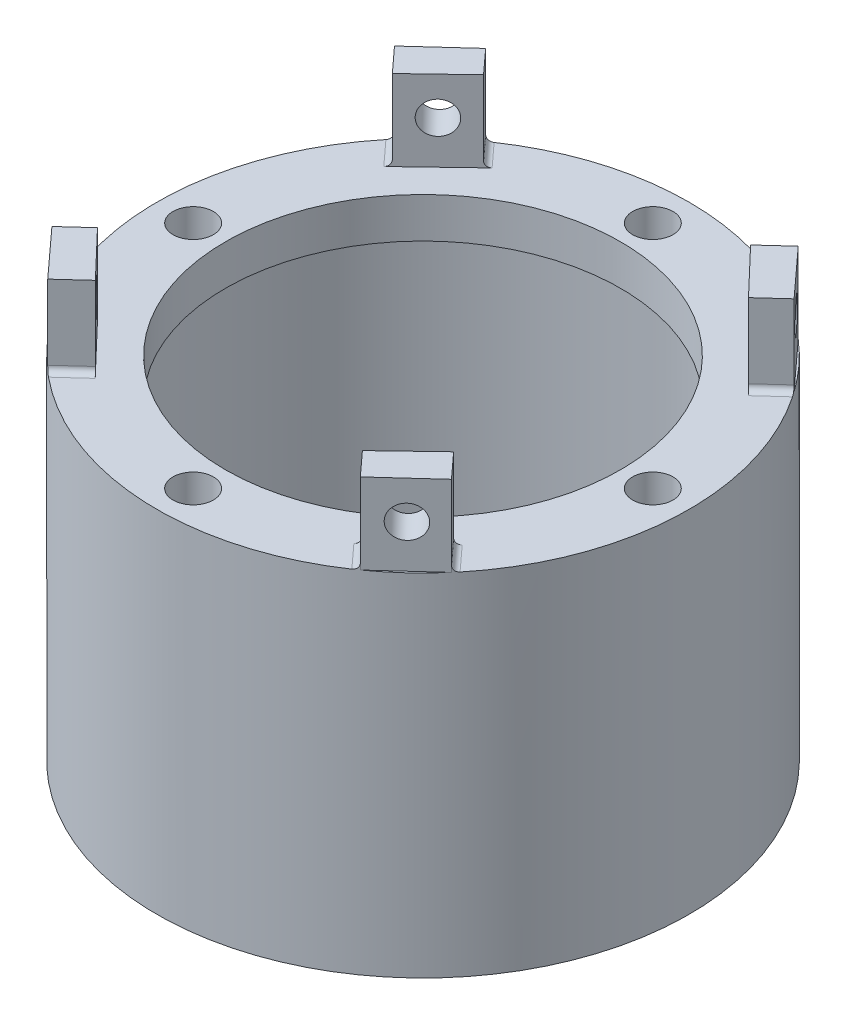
ISO-10303-21;
HEADER;
FILE_DESCRIPTION(('STEP AP214'),'2;1');
FILE_NAME('part.step','',(''),(''),'','','');
FILE_SCHEMA(('AUTOMOTIVE_DESIGN { 1 0 10303 214 1 1 1 1 }'));
ENDSEC;
DATA;
#1=APPLICATION_CONTEXT('core data for automotive mechanical design processes');
#2=APPLICATION_PROTOCOL_DEFINITION('international standard','automotive_design',2000,#1);
#3=PRODUCT_CONTEXT('',#1,'mechanical');
#4=PRODUCT('Part','Part','',(#3));
#5=PRODUCT_RELATED_PRODUCT_CATEGORY('part','',(#4));
#6=PRODUCT_DEFINITION_FORMATION('','',#4);
#7=PRODUCT_DEFINITION_CONTEXT('part definition',#1,'design');
#8=PRODUCT_DEFINITION('design','',#6,#7);
#9=PRODUCT_DEFINITION_SHAPE('','',#8);
#10=(LENGTH_UNIT() NAMED_UNIT(*) SI_UNIT(.MILLI.,.METRE.));
#11=(NAMED_UNIT(*) PLANE_ANGLE_UNIT() SI_UNIT($,.RADIAN.));
#12=(NAMED_UNIT(*) SI_UNIT($,.STERADIAN.) SOLID_ANGLE_UNIT());
#13=UNCERTAINTY_MEASURE_WITH_UNIT(LENGTH_MEASURE(1.E-05),#10,'distance_accuracy_value','');
#14=(GEOMETRIC_REPRESENTATION_CONTEXT(3) GLOBAL_UNCERTAINTY_ASSIGNED_CONTEXT((#13)) GLOBAL_UNIT_ASSIGNED_CONTEXT((#10,
#11,#12)) REPRESENTATION_CONTEXT('',''));
#15=CARTESIAN_POINT('',(0.,0.,0.));
#16=DIRECTION('',(0.,0.,1.));
#17=DIRECTION('',(1.,0.,0.));
#18=AXIS2_PLACEMENT_3D('',#15,#16,#17);
#19=CARTESIAN_POINT('',(0.,5.,0.));
#20=DIRECTION('',(0.,1.,0.));
#21=DIRECTION('',(0.,0.,1.));
#22=AXIS2_PLACEMENT_3D('',#19,#20,#21);
#23=PLANE('',#22);
#24=CARTESIAN_POINT('',(0.,5.,0.));
#25=DIRECTION('',(0.,1.,0.));
#26=DIRECTION('',(0.,0.,1.));
#27=AXIS2_PLACEMENT_3D('',#24,#25,#26);
#28=CIRCLE('',#27,33.);
#29=CARTESIAN_POINT('',(-19.124163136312,5.,-26.8936123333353));
#30=VERTEX_POINT('',#29);
#31=CARTESIAN_POINT('',(-25.0337959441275,5.,-21.5013734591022));
#32=VERTEX_POINT('',#31);
#33=EDGE_CURVE('E564',#30,#32,#28,.T.);
#34=ORIENTED_EDGE('',*,*,#33,.T.);
#35=DIRECTION('',(-0.738704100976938,0.,0.674029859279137));
#36=VECTOR('',#35,1.);
#37=CARTESIAN_POINT('',(-19.124163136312,5.,-26.8936123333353));
#38=LINE('',#37,#36);
#39=EDGE_CURVE('E572',#30,#32,#38,.T.);
#40=ORIENTED_EDGE('',*,*,#39,.F.);
#41=EDGE_LOOP('',(#34,#40));
#42=FACE_BOUND('',#41,.T.);
#43=ADVANCED_FACE('F40',(#42),#23,.T.);
#44=CARTESIAN_POINT('',(0.,5.,28.499999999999));
#45=DIRECTION('',(0.,1.,0.));
#46=DIRECTION('',(0.,0.,1.));
#47=AXIS2_PLACEMENT_3D('',#44,#45,#46);
#48=CIRCLE('',#47,2.50020623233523);
#49=CARTESIAN_POINT('',(0.,5.,31.0002062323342));
#50=VERTEX_POINT('',#49);
#51=EDGE_CURVE('E343',#50,#50,#48,.T.);
#52=ORIENTED_EDGE('',*,*,#51,.F.);
#53=EDGE_LOOP('',(#52));
#54=FACE_BOUND('',#53,.T.);
#55=CARTESIAN_POINT('',(28.4999999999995,5.,-5.15244067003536E-13));
#56=DIRECTION('',(0.,1.,0.));
#57=DIRECTION('',(0.,0.,1.));
#58=AXIS2_PLACEMENT_3D('',#55,#56,#57);
#59=CIRCLE('',#58,2.50020623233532);
#60=CARTESIAN_POINT('',(28.4999999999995,5.,2.50020623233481));
#61=VERTEX_POINT('',#60);
#62=EDGE_CURVE('E346',#61,#61,#59,.T.);
#63=ORIENTED_EDGE('',*,*,#62,.F.);
#64=EDGE_LOOP('',(#63));
#65=FACE_BOUND('',#64,.T.);
#66=CARTESIAN_POINT('',(0.,5.,0.));
#67=DIRECTION('',(0.,1.,0.));
#68=DIRECTION('',(0.,0.,1.));
#69=AXIS2_PLACEMENT_3D('',#66,#67,#68);
#70=CIRCLE('',#69,24.5);
#71=CARTESIAN_POINT('',(0.,5.,24.5));
#72=VERTEX_POINT('',#71);
#73=EDGE_CURVE('E350',#72,#72,#70,.T.);
#74=ORIENTED_EDGE('',*,*,#73,.F.);
#75=EDGE_LOOP('',(#74));
#76=FACE_BOUND('',#75,.T.);
#77=CARTESIAN_POINT('',(-28.4999999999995,5.,-5.01283093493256E-13));
#78=DIRECTION('',(0.,1.,0.));
#79=DIRECTION('',(0.,0.,1.));
#80=AXIS2_PLACEMENT_3D('',#77,#78,#79);
#81=CIRCLE('',#80,2.50020623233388);
#82=CARTESIAN_POINT('',(-28.4999999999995,5.,2.50020623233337));
#83=VERTEX_POINT('',#82);
#84=EDGE_CURVE('E353',#83,#83,#81,.T.);
#85=ORIENTED_EDGE('',*,*,#84,.F.);
#86=EDGE_LOOP('',(#85));
#87=FACE_BOUND('',#86,.T.);
#88=CARTESIAN_POINT('',(0.,5.,-28.5));
#89=DIRECTION('',(0.,1.,0.));
#90=DIRECTION('',(0.,0.,1.));
#91=AXIS2_PLACEMENT_3D('',#88,#89,#90);
#92=CIRCLE('',#91,2.50020623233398);
#93=CARTESIAN_POINT('',(0.,5.,-25.999793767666));
#94=VERTEX_POINT('',#93);
#95=EDGE_CURVE('E356',#94,#94,#92,.T.);
#96=ORIENTED_EDGE('',*,*,#95,.F.);
#97=EDGE_LOOP('',(#96));
#98=FACE_BOUND('',#97,.T.);
#99=CARTESIAN_POINT('',(20.9217804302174,5.,-25.520170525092));
#100=VERTEX_POINT('',#99);
#101=CARTESIAN_POINT('',(-18.5025136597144,5.,-27.3250249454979));
#102=VERTEX_POINT('',#101);
#103=EDGE_CURVE('E364',#100,#102,#28,.T.);
#104=ORIENTED_EDGE('',*,*,#103,.T.);
#105=DIRECTION('',(-0.674029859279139,0.,-0.738704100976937));
#106=VECTOR('',#105,1.);
#107=CARTESIAN_POINT('',(3.50884447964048,5.,-3.20164183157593));
#108=LINE('',#107,#106);
#109=CARTESIAN_POINT('',(-15.8855808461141,5.,-24.456993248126));
#110=VERTEX_POINT('',#109);
#111=EDGE_CURVE('E598',#102,#110,#108,.F.);
#112=ORIENTED_EDGE('',*,*,#111,.T.);
#113=DIRECTION('',(0.723094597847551,0.,-0.690749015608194));
#114=VECTOR('',#113,1.);
#115=CARTESIAN_POINT('',(-22.2128004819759,5.,-18.412803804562));
#116=LINE('',#115,#114);
#117=CARTESIAN_POINT('',(-22.75525719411,5.,-17.8946123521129));
#118=VERTEX_POINT('',#117);
#119=EDGE_CURVE('E57',#118,#110,#116,.T.);
#120=ORIENTED_EDGE('',*,*,#119,.F.);
#121=DIRECTION('',(0.67439934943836,0.,0.738366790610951));
#122=VECTOR('',#121,1.);
#123=CARTESIAN_POINT('',(-3.49514138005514,5.,3.19234437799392));
#124=LINE('',#123,#122);
#125=CARTESIAN_POINT('',(-25.5201705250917,5.,-20.9217804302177));
#126=VERTEX_POINT('',#125);
#127=EDGE_CURVE('E790',#118,#126,#124,.F.);
#128=ORIENTED_EDGE('',*,*,#127,.T.);
#129=CARTESIAN_POINT('',(-27.3250249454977,5.,18.5025136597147));
#130=VERTEX_POINT('',#129);
#131=EDGE_CURVE('E365',#126,#130,#28,.T.);
#132=ORIENTED_EDGE('',*,*,#131,.T.);
#133=DIRECTION('',(-0.73870410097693,0.,0.674029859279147));
#134=VECTOR('',#133,1.);
#135=CARTESIAN_POINT('',(-3.20164183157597,5.,-3.50884447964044));
#136=LINE('',#135,#134);
#137=CARTESIAN_POINT('',(-24.4569932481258,5.,15.8855808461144));
#138=VERTEX_POINT('',#137);
#139=EDGE_CURVE('E512',#130,#138,#136,.F.);
#140=ORIENTED_EDGE('',*,*,#139,.T.);
#141=DIRECTION('',(-0.690749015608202,0.,-0.723094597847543));
#142=VECTOR('',#141,1.);
#143=CARTESIAN_POINT('',(-18.4128038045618,5.,22.2128004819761));
#144=LINE('',#143,#142);
#145=CARTESIAN_POINT('',(-17.8946123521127,5.,22.7552571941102));
#146=VERTEX_POINT('',#145);
#147=EDGE_CURVE('E250',#146,#138,#144,.T.);
#148=ORIENTED_EDGE('',*,*,#147,.F.);
#149=DIRECTION('',(0.738366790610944,0.,-0.674399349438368));
#150=VECTOR('',#149,1.);
#151=CARTESIAN_POINT('',(3.19234437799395,5.,3.49514138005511));
#152=LINE('',#151,#150);
#153=CARTESIAN_POINT('',(-20.9217804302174,5.,25.5201705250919));
#154=VERTEX_POINT('',#153);
#155=EDGE_CURVE('E455',#146,#154,#152,.F.);
#156=ORIENTED_EDGE('',*,*,#155,.T.);
#157=CARTESIAN_POINT('',(18.5025136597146,5.,27.3250249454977));
#158=VERTEX_POINT('',#157);
#159=EDGE_CURVE('E561',#154,#158,#28,.T.);
#160=ORIENTED_EDGE('',*,*,#159,.T.);
#161=DIRECTION('',(0.674029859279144,0.,0.738704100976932));
#162=VECTOR('',#161,1.);
#163=CARTESIAN_POINT('',(-3.50884447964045,5.,3.20164183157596));
#164=LINE('',#163,#162);
#165=CARTESIAN_POINT('',(15.8855808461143,5.,24.4569932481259));
#166=VERTEX_POINT('',#165);
#167=EDGE_CURVE('E495',#158,#166,#164,.F.);
#168=ORIENTED_EDGE('',*,*,#167,.T.);
#169=DIRECTION('',(-0.723094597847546,0.,0.690749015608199));
#170=VECTOR('',#169,1.);
#171=CARTESIAN_POINT('',(22.212800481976,5.,18.4128038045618));
#172=LINE('',#171,#170);
#173=CARTESIAN_POINT('',(22.7552571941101,5.,17.8946123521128));
#174=VERTEX_POINT('',#173);
#175=EDGE_CURVE('E282',#174,#166,#172,.T.);
#176=ORIENTED_EDGE('',*,*,#175,.F.);
#177=DIRECTION('',(-0.674399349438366,0.,-0.738366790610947));
#178=VECTOR('',#177,1.);
#179=CARTESIAN_POINT('',(3.49514138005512,5.,-3.19234437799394));
#180=LINE('',#179,#178);
#181=CARTESIAN_POINT('',(25.5201705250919,5.,20.9217804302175));
#182=VERTEX_POINT('',#181);
#183=EDGE_CURVE('E437',#174,#182,#180,.F.);
#184=ORIENTED_EDGE('',*,*,#183,.T.);
#185=CARTESIAN_POINT('',(27.3250249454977,5.,-18.5025136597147));
#186=VERTEX_POINT('',#185);
#187=EDGE_CURVE('E359',#182,#186,#28,.T.);
#188=ORIENTED_EDGE('',*,*,#187,.T.);
#189=DIRECTION('',(0.73870410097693,0.,-0.674029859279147));
#190=VECTOR('',#189,1.);
#191=CARTESIAN_POINT('',(3.20164183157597,5.,3.50884447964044));
#192=LINE('',#191,#190);
#193=CARTESIAN_POINT('',(24.4569932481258,5.,-15.8855808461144));
#194=VERTEX_POINT('',#193);
#195=EDGE_CURVE('E429',#186,#194,#192,.F.);
#196=ORIENTED_EDGE('',*,*,#195,.T.);
#197=DIRECTION('',(0.690749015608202,0.,0.723094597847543));
#198=VECTOR('',#197,1.);
#199=CARTESIAN_POINT('',(18.4128038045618,5.,-22.2128004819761));
#200=LINE('',#199,#198);
#201=CARTESIAN_POINT('',(17.8946123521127,5.,-22.7552571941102));
#202=VERTEX_POINT('',#201);
#203=EDGE_CURVE('E313',#202,#194,#200,.T.);
#204=ORIENTED_EDGE('',*,*,#203,.F.);
#205=DIRECTION('',(-0.738366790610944,0.,0.674399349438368));
#206=VECTOR('',#205,1.);
#207=CARTESIAN_POINT('',(-3.19234437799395,5.,-3.49514138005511));
#208=LINE('',#207,#206);
#209=EDGE_CURVE('E381',#202,#100,#208,.F.);
#210=ORIENTED_EDGE('',*,*,#209,.T.);
#211=EDGE_LOOP('',(#104,#112,#120,#128,#132,#140,#148,#156,#160,#168,#176,#184,#188,#196,#204,#210));
#212=FACE_BOUND('',#211,.T.);
#213=ADVANCED_FACE('F535',(#54,#65,#76,#87,#98,#212),#23,.T.);
#214=CARTESIAN_POINT('',(-26.8936123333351,5.,19.1241631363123));
#215=VERTEX_POINT('',#214);
#216=CARTESIAN_POINT('',(-21.5013734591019,5.,25.0337959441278));
#217=VERTEX_POINT('',#216);
#218=EDGE_CURVE('E562',#215,#217,#28,.T.);
#219=ORIENTED_EDGE('',*,*,#218,.T.);
#220=DIRECTION('',(0.674029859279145,0.,0.738704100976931));
#221=VECTOR('',#220,1.);
#222=CARTESIAN_POINT('',(-26.8936123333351,5.,19.1241631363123));
#223=LINE('',#222,#221);
#224=EDGE_CURVE('E247',#215,#217,#223,.T.);
#225=ORIENTED_EDGE('',*,*,#224,.F.);
#226=EDGE_LOOP('',(#219,#225));
#227=FACE_BOUND('',#226,.T.);
#228=ADVANCED_FACE('F542',(#227),#23,.T.);
#229=CARTESIAN_POINT('',(19.1241631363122,5.,26.8936123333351));
#230=VERTEX_POINT('',#229);
#231=CARTESIAN_POINT('',(25.0337959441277,5.,21.501373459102));
#232=VERTEX_POINT('',#231);
#233=EDGE_CURVE('E559',#230,#232,#28,.T.);
#234=ORIENTED_EDGE('',*,*,#233,.T.);
#235=DIRECTION('',(0.738704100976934,0.,-0.674029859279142));
#236=VECTOR('',#235,1.);
#237=CARTESIAN_POINT('',(19.1241631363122,5.,26.8936123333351));
#238=LINE('',#237,#236);
#239=EDGE_CURVE('E277',#230,#232,#238,.T.);
#240=ORIENTED_EDGE('',*,*,#239,.F.);
#241=EDGE_LOOP('',(#234,#240));
#242=FACE_BOUND('',#241,.T.);
#243=ADVANCED_FACE('F538',(#242),#23,.T.);
#244=DIRECTION('',(-0.674029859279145,0.,-0.738704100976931));
#245=VECTOR('',#244,1.);
#246=CARTESIAN_POINT('',(26.8936123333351,5.,-19.1241631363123));
#247=LINE('',#246,#245);
#248=CARTESIAN_POINT('',(26.8936123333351,5.,-19.1241631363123));
#249=VERTEX_POINT('',#248);
#250=CARTESIAN_POINT('',(21.5013734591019,5.,-25.0337959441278));
#251=VERTEX_POINT('',#250);
#252=EDGE_CURVE('E308',#249,#251,#247,.T.);
#253=ORIENTED_EDGE('',*,*,#252,.F.);
#254=EDGE_CURVE('E360',#249,#251,#28,.T.);
#255=ORIENTED_EDGE('',*,*,#254,.T.);
#256=EDGE_LOOP('',(#253,#255));
#257=FACE_BOUND('',#256,.T.);
#258=ADVANCED_FACE('F547',(#257),#23,.T.);
#259=CARTESIAN_POINT('',(0.,0.,0.));
#260=DIRECTION('',(0.,1.,0.));
#261=DIRECTION('',(0.,0.,1.));
#262=AXIS2_PLACEMENT_3D('',#259,#260,#261);
#263=PLANE('',#262);
#264=CARTESIAN_POINT('',(0.,0.,-28.5));
#265=DIRECTION('',(0.,1.,0.));
#266=DIRECTION('',(0.,0.,1.));
#267=AXIS2_PLACEMENT_3D('',#264,#265,#266);
#268=CIRCLE('',#267,2.50020623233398);
#269=CARTESIAN_POINT('',(0.,0.,-25.999793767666));
#270=VERTEX_POINT('',#269);
#271=EDGE_CURVE('E347',#270,#270,#268,.T.);
#272=ORIENTED_EDGE('',*,*,#271,.T.);
#273=EDGE_LOOP('',(#272));
#274=FACE_BOUND('',#273,.T.);
#275=CARTESIAN_POINT('',(-28.4999999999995,0.,-5.01283093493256E-13));
#276=DIRECTION('',(0.,1.,0.));
#277=DIRECTION('',(0.,0.,1.));
#278=AXIS2_PLACEMENT_3D('',#275,#276,#277);
#279=CIRCLE('',#278,2.50020623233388);
#280=CARTESIAN_POINT('',(-28.4999999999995,0.,2.50020623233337));
#281=VERTEX_POINT('',#280);
#282=EDGE_CURVE('E374',#281,#281,#279,.T.);
#283=ORIENTED_EDGE('',*,*,#282,.T.);
#284=EDGE_LOOP('',(#283));
#285=FACE_BOUND('',#284,.T.);
#286=CARTESIAN_POINT('',(0.,0.,0.));
#287=DIRECTION('',(0.,1.,0.));
#288=DIRECTION('',(0.,0.,1.));
#289=AXIS2_PLACEMENT_3D('',#286,#287,#288);
#290=CIRCLE('',#289,24.5);
#291=CARTESIAN_POINT('',(0.,0.,24.5));
#292=VERTEX_POINT('',#291);
#293=EDGE_CURVE('E371',#292,#292,#290,.T.);
#294=ORIENTED_EDGE('',*,*,#293,.T.);
#295=EDGE_LOOP('',(#294));
#296=FACE_BOUND('',#295,.T.);
#297=CARTESIAN_POINT('',(28.4999999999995,0.,-5.15244067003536E-13));
#298=DIRECTION('',(0.,1.,0.));
#299=DIRECTION('',(0.,0.,1.));
#300=AXIS2_PLACEMENT_3D('',#297,#298,#299);
#301=CIRCLE('',#300,2.50020623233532);
#302=CARTESIAN_POINT('',(28.4999999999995,0.,2.50020623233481));
#303=VERTEX_POINT('',#302);
#304=EDGE_CURVE('E368',#303,#303,#301,.T.);
#305=ORIENTED_EDGE('',*,*,#304,.T.);
#306=EDGE_LOOP('',(#305));
#307=FACE_BOUND('',#306,.T.);
#308=CARTESIAN_POINT('',(0.,0.,28.499999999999));
#309=DIRECTION('',(0.,1.,0.));
#310=DIRECTION('',(0.,0.,1.));
#311=AXIS2_PLACEMENT_3D('',#308,#309,#310);
#312=CIRCLE('',#311,2.50020623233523);
#313=CARTESIAN_POINT('',(0.,0.,31.0002062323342));
#314=VERTEX_POINT('',#313);
#315=EDGE_CURVE('E342',#314,#314,#312,.T.);
#316=ORIENTED_EDGE('',*,*,#315,.T.);
#317=EDGE_LOOP('',(#316));
#318=FACE_BOUND('',#317,.T.);
#319=CARTESIAN_POINT('',(0.,0.,0.));
#320=DIRECTION('',(0.,-1.,0.));
#321=DIRECTION('',(0.,0.,-1.));
#322=AXIS2_PLACEMENT_3D('',#319,#320,#321);
#323=CIRCLE('',#322,32.05);
#324=CARTESIAN_POINT('',(0.,0.,-32.05));
#325=VERTEX_POINT('',#324);
#326=EDGE_CURVE('E333',#325,#325,#323,.T.);
#327=ORIENTED_EDGE('',*,*,#326,.T.);
#328=EDGE_LOOP('',(#327));
#329=FACE_BOUND('',#328,.T.);
#330=ADVANCED_FACE('F553',(#274,#285,#296,#307,#318,#329),#263,.F.);
#331=CARTESIAN_POINT('',(0.,5.,-28.5));
#332=DIRECTION('',(0.,-1.,0.));
#333=DIRECTION('',(0.,0.,-1.));
#334=AXIS2_PLACEMENT_3D('',#331,#332,#333);
#335=CYLINDRICAL_SURFACE('',#334,2.50020623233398);
#336=ORIENTED_EDGE('',*,*,#95,.T.);
#337=EDGE_LOOP('',(#336));
#338=FACE_BOUND('',#337,.T.);
#339=ORIENTED_EDGE('',*,*,#271,.F.);
#340=EDGE_LOOP('',(#339));
#341=FACE_BOUND('',#340,.T.);
#342=ADVANCED_FACE('F702',(#338,#341),#335,.F.);
#343=CARTESIAN_POINT('',(-28.4999999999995,5.,-5.01283093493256E-13));
#344=DIRECTION('',(0.,-1.,0.));
#345=DIRECTION('',(0.,0.,-1.));
#346=AXIS2_PLACEMENT_3D('',#343,#344,#345);
#347=CYLINDRICAL_SURFACE('',#346,2.50020623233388);
#348=ORIENTED_EDGE('',*,*,#84,.T.);
#349=EDGE_LOOP('',(#348));
#350=FACE_BOUND('',#349,.T.);
#351=ORIENTED_EDGE('',*,*,#282,.F.);
#352=EDGE_LOOP('',(#351));
#353=FACE_BOUND('',#352,.T.);
#354=ADVANCED_FACE('F707',(#350,#353),#347,.F.);
#355=CARTESIAN_POINT('',(0.,5.,0.));
#356=DIRECTION('',(0.,-1.,0.));
#357=DIRECTION('',(0.,0.,-1.));
#358=AXIS2_PLACEMENT_3D('',#355,#356,#357);
#359=CYLINDRICAL_SURFACE('',#358,24.5);
#360=ORIENTED_EDGE('',*,*,#73,.T.);
#361=EDGE_LOOP('',(#360));
#362=FACE_BOUND('',#361,.T.);
#363=ORIENTED_EDGE('',*,*,#293,.F.);
#364=EDGE_LOOP('',(#363));
#365=FACE_BOUND('',#364,.T.);
#366=ADVANCED_FACE('F725',(#362,#365),#359,.F.);
#367=CARTESIAN_POINT('',(28.4999999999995,5.,-5.15244067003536E-13));
#368=DIRECTION('',(0.,-1.,0.));
#369=DIRECTION('',(0.,0.,-1.));
#370=AXIS2_PLACEMENT_3D('',#367,#368,#369);
#371=CYLINDRICAL_SURFACE('',#370,2.50020623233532);
#372=ORIENTED_EDGE('',*,*,#62,.T.);
#373=EDGE_LOOP('',(#372));
#374=FACE_BOUND('',#373,.T.);
#375=ORIENTED_EDGE('',*,*,#304,.F.);
#376=EDGE_LOOP('',(#375));
#377=FACE_BOUND('',#376,.T.);
#378=ADVANCED_FACE('F720',(#374,#377),#371,.F.);
#379=CARTESIAN_POINT('',(0.,5.,28.499999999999));
#380=DIRECTION('',(0.,-1.,0.));
#381=DIRECTION('',(0.,0.,-1.));
#382=AXIS2_PLACEMENT_3D('',#379,#380,#381);
#383=CYLINDRICAL_SURFACE('',#382,2.50020623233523);
#384=ORIENTED_EDGE('',*,*,#51,.T.);
#385=EDGE_LOOP('',(#384));
#386=FACE_BOUND('',#385,.T.);
#387=ORIENTED_EDGE('',*,*,#315,.F.);
#388=EDGE_LOOP('',(#387));
#389=FACE_BOUND('',#388,.T.);
#390=ADVANCED_FACE('F409',(#386,#389),#383,.F.);
#391=CARTESIAN_POINT('',(0.,5.,0.));
#392=DIRECTION('',(0.,-1.,0.));
#393=DIRECTION('',(0.,0.,-1.));
#394=AXIS2_PLACEMENT_3D('',#391,#392,#393);
#395=CYLINDRICAL_SURFACE('',#394,33.);
#396=ORIENTED_EDGE('',*,*,#254,.F.);
#397=DIRECTION('',(0.,-1.,0.));
#398=VECTOR('',#397,1.);
#399=CARTESIAN_POINT('',(26.8936123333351,5.,-19.1241631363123));
#400=LINE('',#399,#398);
#401=CARTESIAN_POINT('',(26.8936123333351,5.74999719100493,-19.1241631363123));
#402=VERTEX_POINT('',#401);
#403=EDGE_CURVE('E431',#249,#402,#400,.F.);
#404=ORIENTED_EDGE('',*,*,#403,.T.);
#405=CARTESIAN_POINT('',(26.8936123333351,5.74999719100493,-19.1241631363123));
#406=CARTESIAN_POINT('',(26.8935891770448,5.70804168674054,-19.1241917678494));
#407=CARTESIAN_POINT('',(26.8956665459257,5.66609842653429,-19.1212743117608));
#408=CARTESIAN_POINT('',(26.9038497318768,5.58344118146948,-19.109760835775));
#409=CARTESIAN_POINT('',(26.9099516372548,5.54272604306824,-19.1011703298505));
#410=CARTESIAN_POINT('',(26.9260152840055,5.46362724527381,-19.0785188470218));
#411=CARTESIAN_POINT('',(26.935978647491,5.42524457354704,-19.0644555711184));
#412=CARTESIAN_POINT('',(26.9594402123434,5.3519111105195,-19.0312636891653));
#413=CARTESIAN_POINT('',(26.9729379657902,5.31695988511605,-19.0121357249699));
#414=CARTESIAN_POINT('',(27.0030922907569,5.25136058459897,-18.9692828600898));
#415=CARTESIAN_POINT('',(27.019757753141,5.22072505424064,-18.9455450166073));
#416=CARTESIAN_POINT('',(27.0557125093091,5.16471088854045,-18.89416317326));
#417=CARTESIAN_POINT('',(27.0750023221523,5.13933329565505,-18.8665184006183));
#418=CARTESIAN_POINT('',(27.1157694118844,5.09436128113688,-18.8078795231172));
#419=CARTESIAN_POINT('',(27.1372615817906,5.0748102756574,-18.7768625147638));
#420=CARTESIAN_POINT('',(27.1816763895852,5.04226598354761,-18.7125090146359));
#421=CARTESIAN_POINT('',(27.2045984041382,5.02926986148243,-18.6791735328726));
#422=CARTESIAN_POINT('',(27.2438769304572,5.01316178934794,-18.6218143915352));
#423=CARTESIAN_POINT('',(27.2600368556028,5.0082279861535,-18.5981507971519));
#424=CARTESIAN_POINT('',(27.2924816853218,5.00164739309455,-18.5505062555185));
#425=CARTESIAN_POINT('',(27.3087663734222,4.99999582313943,-18.5265258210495));
#426=CARTESIAN_POINT('',(27.3250249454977,5.,-18.5025136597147));
#427=B_SPLINE_CURVE_WITH_KNOTS('',3,(#405,#406,#407,#408,#409,#410,#411,#412,#413,#414,#415,
#416,#417,#418,#419,#420,#421,#422,#423,#424,#425,#426),.UNSPECIFIED.,.F.,.F.,(4,2,2,2,2,2,2,2,
2,2,4),(0.,0.125696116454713,0.251270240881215,0.376897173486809,0.502508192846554,
0.628477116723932,0.754470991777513,0.881381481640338,1.00823702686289,1.09529016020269,
1.18221642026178),.UNSPECIFIED.);
#428=EDGE_CURVE('E420',#402,#186,#427,.T.);
#429=ORIENTED_EDGE('',*,*,#428,.T.);
#430=ORIENTED_EDGE('',*,*,#187,.F.);
#431=CARTESIAN_POINT('',(25.5201705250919,5.,20.9217804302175));
#432=CARTESIAN_POINT('',(25.492999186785,4.9999651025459,20.9549288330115));
#433=CARTESIAN_POINT('',(25.4657623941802,5.00359661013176,20.9880153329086));
#434=CARTESIAN_POINT('',(25.4119442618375,5.01795243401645,21.0531426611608));
#435=CARTESIAN_POINT('',(25.3853626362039,5.0286735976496,21.0851839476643));
#436=CARTESIAN_POINT('',(25.3335990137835,5.05697823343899,21.1473500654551));
#437=CARTESIAN_POINT('',(25.3084179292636,5.07456611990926,21.1774736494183));
#438=CARTESIAN_POINT('',(25.2602341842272,5.11611376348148,21.2349233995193));
#439=CARTESIAN_POINT('',(25.2372309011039,5.14007169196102,21.2622503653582));
#440=CARTESIAN_POINT('',(25.1942249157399,5.1935459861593,21.3131916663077));
#441=CARTESIAN_POINT('',(25.1742057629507,5.22302968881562,21.3368263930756));
#442=CARTESIAN_POINT('',(25.1376291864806,5.28682568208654,21.3799064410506));
#443=CARTESIAN_POINT('',(25.1210724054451,5.32113886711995,21.3993509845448));
#444=CARTESIAN_POINT('',(25.0920716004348,5.39330345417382,21.4333487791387));
#445=CARTESIAN_POINT('',(25.0795947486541,5.4311233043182,21.4479410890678));
#446=CARTESIAN_POINT('',(25.0589679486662,5.50945466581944,21.4720371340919));
#447=CARTESIAN_POINT('',(25.0508149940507,5.54996428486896,21.4815444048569));
#448=CARTESIAN_POINT('',(25.0412450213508,5.61729345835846,21.4926982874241));
#449=CARTESIAN_POINT('',(25.0384535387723,5.64367053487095,21.4959498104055));
#450=CARTESIAN_POINT('',(25.0347292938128,5.69669358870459,21.5002867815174));
#451=CARTESIAN_POINT('',(25.033793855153,5.72333912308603,21.5013753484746));
#452=CARTESIAN_POINT('',(25.0337959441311,5.74999719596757,21.501373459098));
#453=B_SPLINE_CURVE_WITH_KNOTS('',3,(#431,#432,#433,#434,#435,#436,#437,#438,#439,#440,#441,
#442,#443,#444,#445,#446,#447,#448,#449,#450,#451,#452),.UNSPECIFIED.,.F.,.F.,(4,2,2,2,2,2,2,2,
2,2,4),(0.,0.128421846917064,0.256786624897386,0.385234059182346,0.513644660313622,
0.641318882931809,0.769016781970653,0.895660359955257,1.02221576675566,1.10224240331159,
1.18215356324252),.UNSPECIFIED.);
#454=CARTESIAN_POINT('',(25.0337959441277,5.75,21.501373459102));
#455=VERTEX_POINT('',#454);
#456=EDGE_CURVE('E442',#182,#455,#453,.T.);
#457=ORIENTED_EDGE('',*,*,#456,.T.);
#458=DIRECTION('',(0.,-1.,0.));
#459=VECTOR('',#458,1.);
#460=CARTESIAN_POINT('',(25.0337959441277,5.,21.501373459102));
#461=LINE('',#460,#459);
#462=EDGE_CURVE('E449',#232,#455,#461,.F.);
#463=ORIENTED_EDGE('',*,*,#462,.F.);
#464=ORIENTED_EDGE('',*,*,#233,.F.);
#465=DIRECTION('',(0.,-1.,0.));
#466=VECTOR('',#465,1.);
#467=CARTESIAN_POINT('',(19.1241631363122,5.,26.8936123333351));
#468=LINE('',#467,#466);
#469=CARTESIAN_POINT('',(19.1241631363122,5.74999718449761,26.8936123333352));
#470=VERTEX_POINT('',#469);
#471=EDGE_CURVE('E506',#230,#470,#468,.F.);
#472=ORIENTED_EDGE('',*,*,#471,.T.);
#473=CARTESIAN_POINT('',(19.1241631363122,5.74999718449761,26.8936123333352));
#474=CARTESIAN_POINT('',(19.1241917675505,5.7080416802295,26.8935891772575));
#475=CARTESIAN_POINT('',(19.1212743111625,5.66609842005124,26.8956665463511));
#476=CARTESIAN_POINT('',(19.109760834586,5.58344117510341,26.9038497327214));
#477=CARTESIAN_POINT('',(19.10117032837,5.54272603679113,26.9099516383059));
#478=CARTESIAN_POINT('',(19.078518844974,5.46362723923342,26.9260152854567));
#479=CARTESIAN_POINT('',(19.0644555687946,5.42524456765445,26.935978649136));
#480=CARTESIAN_POINT('',(19.0312636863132,5.35191110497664,26.959440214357));
#481=CARTESIAN_POINT('',(19.0121357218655,5.31695987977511,26.9729379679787));
#482=CARTESIAN_POINT('',(18.969282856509,5.25136057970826,27.0030922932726));
#483=CARTESIAN_POINT('',(18.9455450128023,5.22072504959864,27.0197577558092));
#484=CARTESIAN_POINT('',(18.8941631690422,5.16471088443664,27.0557125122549));
#485=CARTESIAN_POINT('',(18.8665183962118,5.13933329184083,27.0750023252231));
#486=CARTESIAN_POINT('',(18.8078795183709,5.094361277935,27.1157694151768));
#487=CARTESIAN_POINT('',(18.7768625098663,5.07481027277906,27.1372615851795));
#488=CARTESIAN_POINT('',(18.7125090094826,5.04226598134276,27.1816763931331));
#489=CARTESIAN_POINT('',(18.6791735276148,5.02926985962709,27.2045984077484));
#490=CARTESIAN_POINT('',(18.6218143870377,5.01316178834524,27.2438769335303));
#491=CARTESIAN_POINT('',(18.5981507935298,5.00822798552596,27.2600368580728));
#492=CARTESIAN_POINT('',(18.5505062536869,5.00164739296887,27.2924816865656));
#493=CARTESIAN_POINT('',(18.5265258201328,4.99999582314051,27.3087663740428));
#494=CARTESIAN_POINT('',(18.5025136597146,5.,27.3250249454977));
#495=B_SPLINE_CURVE_WITH_KNOTS('',3,(#473,#474,#475,#476,#477,#478,#479,#480,#481,#482,#483,
#484,#485,#486,#487,#488,#489,#490,#491,#492,#493,#494),.UNSPECIFIED.,.F.,.F.,(4,2,2,2,2,2,2,2,
2,2,4),(0.,0.125696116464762,0.251270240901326,0.37689717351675,0.502508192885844,
0.628477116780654,0.754470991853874,0.8813814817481,1.00823702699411,1.09529015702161,
1.18221641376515),.UNSPECIFIED.);
#496=EDGE_CURVE('E498',#470,#158,#495,.T.);
#497=ORIENTED_EDGE('',*,*,#496,.T.);
#498=ORIENTED_EDGE('',*,*,#159,.F.);
#499=CARTESIAN_POINT('',(-20.9217804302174,5.,25.520170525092));
#500=CARTESIAN_POINT('',(-20.9549288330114,4.9999651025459,25.492999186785));
#501=CARTESIAN_POINT('',(-20.9880153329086,5.00359661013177,25.4657623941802));
#502=CARTESIAN_POINT('',(-21.0531426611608,5.01795243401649,25.4119442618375));
#503=CARTESIAN_POINT('',(-21.0851839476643,5.02867359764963,25.3853626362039));
#504=CARTESIAN_POINT('',(-21.1473500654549,5.05697823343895,25.3335990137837));
#505=CARTESIAN_POINT('',(-21.177473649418,5.07456611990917,25.3084179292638));
#506=CARTESIAN_POINT('',(-21.2349233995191,5.11611376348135,25.2602341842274));
#507=CARTESIAN_POINT('',(-21.2622503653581,5.14007169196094,25.237230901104));
#508=CARTESIAN_POINT('',(-21.3131916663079,5.19354598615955,25.1942249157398));
#509=CARTESIAN_POINT('',(-21.3368263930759,5.22302968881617,25.1742057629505));
#510=CARTESIAN_POINT('',(-21.3799064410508,5.28682568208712,25.1376291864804));
#511=CARTESIAN_POINT('',(-21.3993509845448,5.32113886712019,25.1210724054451));
#512=CARTESIAN_POINT('',(-21.4333487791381,5.39330345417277,25.0920716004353));
#513=CARTESIAN_POINT('',(-21.4479410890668,5.43112330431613,25.079594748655));
#514=CARTESIAN_POINT('',(-21.4720371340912,5.50945466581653,25.0589679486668));
#515=CARTESIAN_POINT('',(-21.4815444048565,5.54996428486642,25.050814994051));
#516=CARTESIAN_POINT('',(-21.4926982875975,5.61729345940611,25.0412450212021));
#517=CARTESIAN_POINT('',(-21.4959498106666,5.64367053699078,25.0384535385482));
#518=CARTESIAN_POINT('',(-21.5002867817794,5.69669359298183,25.0347292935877));
#519=CARTESIAN_POINT('',(-21.50137534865,5.72333912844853,25.0337938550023));
#520=CARTESIAN_POINT('',(-21.5013734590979,5.74999720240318,25.0337959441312));
#521=B_SPLINE_CURVE_WITH_KNOTS('',3,(#499,#500,#501,#502,#503,#504,#505,#506,#507,#508,#509,
#510,#511,#512,#513,#514,#515,#516,#517,#518,#519,#520),.UNSPECIFIED.,.F.,.F.,(4,2,2,2,2,2,2,2,
2,2,4),(0.,0.128421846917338,0.256786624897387,0.385234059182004,0.513644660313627,
0.64131888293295,0.769016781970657,0.895660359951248,1.02221576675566,1.10224240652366,
1.18215356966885),.UNSPECIFIED.);
#522=CARTESIAN_POINT('',(-21.5013734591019,5.75,25.0337959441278));
#523=VERTEX_POINT('',#522);
#524=EDGE_CURVE('E460',#154,#523,#521,.T.);
#525=ORIENTED_EDGE('',*,*,#524,.T.);
#526=DIRECTION('',(0.,-1.,0.));
#527=VECTOR('',#526,1.);
#528=CARTESIAN_POINT('',(-21.5013734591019,5.,25.0337959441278));
#529=LINE('',#528,#527);
#530=EDGE_CURVE('E467',#217,#523,#529,.F.);
#531=ORIENTED_EDGE('',*,*,#530,.F.);
#532=ORIENTED_EDGE('',*,*,#218,.F.);
#533=DIRECTION('',(0.,-1.,0.));
#534=VECTOR('',#533,1.);
#535=CARTESIAN_POINT('',(-26.8936123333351,5.,19.1241631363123));
#536=LINE('',#535,#534);
#537=CARTESIAN_POINT('',(-26.8936123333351,5.74999719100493,19.1241631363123));
#538=VERTEX_POINT('',#537);
#539=EDGE_CURVE('E599',#215,#538,#536,.F.);
#540=ORIENTED_EDGE('',*,*,#539,.T.);
#541=CARTESIAN_POINT('',(-26.8936123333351,5.74999719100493,19.1241631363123));
#542=CARTESIAN_POINT('',(-26.8935891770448,5.70804168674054,19.1241917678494));
#543=CARTESIAN_POINT('',(-26.8956665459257,5.66609842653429,19.1212743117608));
#544=CARTESIAN_POINT('',(-26.9038497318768,5.58344118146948,19.109760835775));
#545=CARTESIAN_POINT('',(-26.9099516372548,5.54272604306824,19.1011703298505));
#546=CARTESIAN_POINT('',(-26.9260152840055,5.46362724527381,19.0785188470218));
#547=CARTESIAN_POINT('',(-26.935978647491,5.42524457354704,19.0644555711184));
#548=CARTESIAN_POINT('',(-26.9594402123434,5.3519111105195,19.0312636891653));
#549=CARTESIAN_POINT('',(-26.9729379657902,5.31695988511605,19.0121357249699));
#550=CARTESIAN_POINT('',(-27.0030922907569,5.25136058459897,18.9692828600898));
#551=CARTESIAN_POINT('',(-27.019757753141,5.22072505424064,18.9455450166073));
#552=CARTESIAN_POINT('',(-27.0557125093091,5.16471088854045,18.89416317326));
#553=CARTESIAN_POINT('',(-27.0750023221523,5.13933329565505,18.8665184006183));
#554=CARTESIAN_POINT('',(-27.1157694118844,5.09436128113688,18.8078795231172));
#555=CARTESIAN_POINT('',(-27.1372615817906,5.0748102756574,18.7768625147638));
#556=CARTESIAN_POINT('',(-27.1816763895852,5.04226598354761,18.7125090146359));
#557=CARTESIAN_POINT('',(-27.2045984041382,5.02926986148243,18.6791735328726));
#558=CARTESIAN_POINT('',(-27.2438769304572,5.01316178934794,18.6218143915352));
#559=CARTESIAN_POINT('',(-27.2600368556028,5.0082279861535,18.5981507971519));
#560=CARTESIAN_POINT('',(-27.2924816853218,5.00164739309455,18.5505062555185));
#561=CARTESIAN_POINT('',(-27.3087663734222,4.99999582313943,18.5265258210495));
#562=CARTESIAN_POINT('',(-27.3250249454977,5.,18.5025136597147));
#563=B_SPLINE_CURVE_WITH_KNOTS('',3,(#541,#542,#543,#544,#545,#546,#547,#548,#549,#550,#551,
#552,#553,#554,#555,#556,#557,#558,#559,#560,#561,#562),.UNSPECIFIED.,.F.,.F.,(4,2,2,2,2,2,2,2,
2,2,4),(0.,0.125696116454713,0.251270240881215,0.376897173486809,0.502508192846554,
0.628477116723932,0.754470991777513,0.881381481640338,1.00823702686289,1.09529016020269,
1.18221642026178),.UNSPECIFIED.);
#564=EDGE_CURVE('E515',#538,#130,#563,.T.);
#565=ORIENTED_EDGE('',*,*,#564,.T.);
#566=ORIENTED_EDGE('',*,*,#131,.F.);
#567=CARTESIAN_POINT('',(-25.5201705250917,5.,-20.9217804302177));
#568=CARTESIAN_POINT('',(-25.4929991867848,4.9999651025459,-20.9549288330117));
#569=CARTESIAN_POINT('',(-25.4657623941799,5.00359661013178,-20.9880153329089));
#570=CARTESIAN_POINT('',(-25.4119442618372,5.01795243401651,-21.0531426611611));
#571=CARTESIAN_POINT('',(-25.3853626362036,5.02867359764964,-21.0851839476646));
#572=CARTESIAN_POINT('',(-25.3335990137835,5.05697823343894,-21.1473500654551));
#573=CARTESIAN_POINT('',(-25.3084179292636,5.07456611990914,-21.1774736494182));
#574=CARTESIAN_POINT('',(-25.2602341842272,5.11611376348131,-21.2349233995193));
#575=CARTESIAN_POINT('',(-25.2372309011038,5.14007169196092,-21.2622503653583));
#576=CARTESIAN_POINT('',(-25.1942249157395,5.19354598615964,-21.3131916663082));
#577=CARTESIAN_POINT('',(-25.1742057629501,5.22302968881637,-21.3368263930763));
#578=CARTESIAN_POINT('',(-25.1376291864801,5.28682568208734,-21.3799064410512));
#579=CARTESIAN_POINT('',(-25.1210724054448,5.32113886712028,-21.3993509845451));
#580=CARTESIAN_POINT('',(-25.0920716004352,5.39330345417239,-21.4333487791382));
#581=CARTESIAN_POINT('',(-25.079594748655,5.43112330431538,-21.4479410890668));
#582=CARTESIAN_POINT('',(-25.0589679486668,5.50945466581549,-21.4720371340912));
#583=CARTESIAN_POINT('',(-25.0508149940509,5.54996428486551,-21.4815444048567));
#584=CARTESIAN_POINT('',(-25.0412450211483,5.6172934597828,-21.4926982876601));
#585=CARTESIAN_POINT('',(-25.0384535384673,5.64367053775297,-21.4959498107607));
#586=CARTESIAN_POINT('',(-25.0347292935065,5.69669359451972,-21.500286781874));
#587=CARTESIAN_POINT('',(-25.0337938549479,5.72333913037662,-21.5013753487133));
#588=CARTESIAN_POINT('',(-25.033795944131,5.74999720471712,-21.5013734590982));
#589=B_SPLINE_CURVE_WITH_KNOTS('',3,(#567,#568,#569,#570,#571,#572,#573,#574,#575,#576,#577,
#578,#579,#580,#581,#582,#583,#584,#585,#586,#587,#588),.UNSPECIFIED.,.F.,.F.,(4,2,2,2,2,2,2,2,
2,2,4),(0.,0.128421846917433,0.256786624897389,0.38523405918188,0.513644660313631,
0.641318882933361,0.769016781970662,0.895660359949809,1.02221576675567,1.10224240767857,
1.18215357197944),.UNSPECIFIED.);
#590=CARTESIAN_POINT('',(-25.0337959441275,5.75,-21.5013734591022));
#591=VERTEX_POINT('',#590);
#592=EDGE_CURVE('E482',#126,#591,#589,.T.);
#593=ORIENTED_EDGE('',*,*,#592,.T.);
#594=DIRECTION('',(0.,-1.,0.));
#595=VECTOR('',#594,1.);
#596=CARTESIAN_POINT('',(-25.0337959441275,5.,-21.5013734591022));
#597=LINE('',#596,#595);
#598=EDGE_CURVE('E245',#32,#591,#597,.F.);
#599=ORIENTED_EDGE('',*,*,#598,.F.);
#600=ORIENTED_EDGE('',*,*,#33,.F.);
#601=DIRECTION('',(0.,-1.,0.));
#602=VECTOR('',#601,1.);
#603=CARTESIAN_POINT('',(-19.124163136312,5.,-26.8936123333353));
#604=LINE('',#603,#602);
#605=CARTESIAN_POINT('',(-19.124163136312,5.74999719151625,-26.8936123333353));
#606=VERTEX_POINT('',#605);
#607=EDGE_CURVE('E11',#30,#606,#604,.F.);
#608=ORIENTED_EDGE('',*,*,#607,.T.);
#609=CARTESIAN_POINT('',(-19.124163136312,5.74999719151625,-26.8936123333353));
#610=CARTESIAN_POINT('',(-19.1241917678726,5.70804168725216,-26.8935891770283));
#611=CARTESIAN_POINT('',(-19.1212743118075,5.66609842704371,-26.8956665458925));
#612=CARTESIAN_POINT('',(-19.1097608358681,5.5834411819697,-26.9038497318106));
#613=CARTESIAN_POINT('',(-19.1011703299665,5.54272604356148,-26.9099516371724));
#614=CARTESIAN_POINT('',(-19.0785188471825,5.46362724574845,-26.9260152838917));
#615=CARTESIAN_POINT('',(-19.0644555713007,5.42524457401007,-26.935978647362));
#616=CARTESIAN_POINT('',(-19.0312636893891,5.35191111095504,-26.9594402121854));
#617=CARTESIAN_POINT('',(-19.0121357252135,5.31695988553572,-26.9729379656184));
#618=CARTESIAN_POINT('',(-18.9692828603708,5.25136058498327,-27.0030922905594));
#619=CARTESIAN_POINT('',(-18.945545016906,5.2207250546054,-27.0197577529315));
#620=CARTESIAN_POINT('',(-18.8941631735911,5.16471088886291,-27.0557125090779));
#621=CARTESIAN_POINT('',(-18.8665184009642,5.13933329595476,-27.0750023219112));
#622=CARTESIAN_POINT('',(-18.8078795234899,5.09436128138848,-27.1157694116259));
#623=CARTESIAN_POINT('',(-18.7768625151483,5.07481027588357,-27.1372615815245));
#624=CARTESIAN_POINT('',(-18.7125090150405,5.04226598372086,-27.1816763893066));
#625=CARTESIAN_POINT('',(-18.6791735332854,5.02926986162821,-27.2045984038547));
#626=CARTESIAN_POINT('',(-18.6218143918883,5.01316178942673,-27.2438769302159));
#627=CARTESIAN_POINT('',(-18.5981507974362,5.00822798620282,-27.2600368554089));
#628=CARTESIAN_POINT('',(-18.5505062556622,5.00164739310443,-27.2924816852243));
#629=CARTESIAN_POINT('',(-18.5265258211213,4.99999582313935,-27.3087663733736));
#630=CARTESIAN_POINT('',(-18.5025136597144,5.,-27.3250249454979));
#631=B_SPLINE_CURVE_WITH_KNOTS('',3,(#609,#610,#611,#612,#613,#614,#615,#616,#617,#618,#619,
#620,#621,#622,#623,#624,#625,#626,#627,#628,#629,#630),.UNSPECIFIED.,.F.,.F.,(4,2,2,2,2,2,2,2,
2,2,4),(0.,0.125696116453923,0.251270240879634,0.376897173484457,0.502508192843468,
0.628477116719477,0.754470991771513,0.881381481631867,1.00823702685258,1.09529016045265,
1.18221642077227),.UNSPECIFIED.);
#632=EDGE_CURVE('E597',#606,#102,#631,.T.);
#633=ORIENTED_EDGE('',*,*,#632,.T.);
#634=ORIENTED_EDGE('',*,*,#103,.F.);
#635=CARTESIAN_POINT('',(20.9217804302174,5.,-25.520170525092));
#636=CARTESIAN_POINT('',(20.9549288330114,4.9999651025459,-25.492999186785));
#637=CARTESIAN_POINT('',(20.9880153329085,5.00359661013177,-25.4657623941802));
#638=CARTESIAN_POINT('',(21.0531426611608,5.01795243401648,-25.4119442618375));
#639=CARTESIAN_POINT('',(21.0851839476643,5.02867359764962,-25.3853626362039));
#640=CARTESIAN_POINT('',(21.1473500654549,5.05697823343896,-25.3335990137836));
#641=CARTESIAN_POINT('',(21.1774736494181,5.07456611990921,-25.3084179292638));
#642=CARTESIAN_POINT('',(21.2349233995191,5.11611376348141,-25.2602341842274));
#643=CARTESIAN_POINT('',(21.2622503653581,5.14007169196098,-25.237230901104));
#644=CARTESIAN_POINT('',(21.3131916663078,5.19354598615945,-25.1942249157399));
#645=CARTESIAN_POINT('',(21.3368263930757,5.22302968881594,-25.1742057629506));
#646=CARTESIAN_POINT('',(21.3799064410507,5.28682568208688,-25.1376291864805));
#647=CARTESIAN_POINT('',(21.3993509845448,5.3211388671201,-25.1210724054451));
#648=CARTESIAN_POINT('',(21.4333487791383,5.3933034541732,-25.0920716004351));
#649=CARTESIAN_POINT('',(21.4479410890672,5.43112330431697,-25.0795947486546));
#650=CARTESIAN_POINT('',(21.4720371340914,5.50945466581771,-25.0589679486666));
#651=CARTESIAN_POINT('',(21.4815444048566,5.54996428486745,-25.0508149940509));
#652=CARTESIAN_POINT('',(21.492698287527,5.61729345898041,-25.0412450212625));
#653=CARTESIAN_POINT('',(21.4959498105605,5.64367053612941,-25.0384535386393));
#654=CARTESIAN_POINT('',(21.5002867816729,5.69669359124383,-25.0347292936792));
#655=CARTESIAN_POINT('',(21.5013753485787,5.72333912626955,-25.0337938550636));
#656=CARTESIAN_POINT('',(21.5013734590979,5.74999719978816,-25.0337959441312));
#657=B_SPLINE_CURVE_WITH_KNOTS('',3,(#635,#636,#637,#638,#639,#640,#641,#642,#643,#644,#645,
#646,#647,#648,#649,#650,#651,#652,#653,#654,#655,#656),.UNSPECIFIED.,.F.,.F.,(4,2,2,2,2,2,2,2,
2,2,4),(0.,0.128421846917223,0.256786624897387,0.385234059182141,0.513644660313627,
0.641318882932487,0.769016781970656,0.895660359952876,1.02221576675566,1.10224240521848,
1.1821535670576),.UNSPECIFIED.);
#658=CARTESIAN_POINT('',(21.5013734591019,5.75,-25.0337959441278));
#659=VERTEX_POINT('',#658);
#660=EDGE_CURVE('E386',#100,#659,#657,.T.);
#661=ORIENTED_EDGE('',*,*,#660,.T.);
#662=DIRECTION('',(0.,-1.,0.));
#663=VECTOR('',#662,1.);
#664=CARTESIAN_POINT('',(21.5013734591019,5.,-25.0337959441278));
#665=LINE('',#664,#663);
#666=EDGE_CURVE('E395',#251,#659,#665,.F.);
#667=ORIENTED_EDGE('',*,*,#666,.F.);
#668=EDGE_LOOP('',(#396,#404,#429,#430,#457,#463,#464,#472,#497,#498,#525,#531,#532,#540,#565,
#566,#593,#599,#600,#608,#633,#634,#661,#667));
#669=FACE_BOUND('',#668,.T.);
#670=CARTESIAN_POINT('',(0.,-38.5,0.));
#671=DIRECTION('',(0.,-1.,0.));
#672=DIRECTION('',(0.,0.,-1.));
#673=AXIS2_PLACEMENT_3D('',#670,#671,#672);
#674=CIRCLE('',#673,33.);
#675=CARTESIAN_POINT('',(0.,-38.5,-33.));
#676=VERTEX_POINT('',#675);
#677=EDGE_CURVE('E337',#676,#676,#674,.T.);
#678=ORIENTED_EDGE('',*,*,#677,.F.);
#679=EDGE_LOOP('',(#678));
#680=FACE_BOUND('',#679,.T.);
#681=ADVANCED_FACE('F397',(#669,#680),#395,.T.);
#682=CARTESIAN_POINT('',(0.,-38.5,0.));
#683=DIRECTION('',(0.,-1.,0.));
#684=DIRECTION('',(0.,0.,-1.));
#685=AXIS2_PLACEMENT_3D('',#682,#683,#684);
#686=PLANE('',#685);
#687=ORIENTED_EDGE('',*,*,#677,.T.);
#688=EDGE_LOOP('',(#687));
#689=FACE_BOUND('',#688,.T.);
#690=CARTESIAN_POINT('',(0.,-38.5,0.));
#691=DIRECTION('',(0.,-1.,0.));
#692=DIRECTION('',(0.,0.,-1.));
#693=AXIS2_PLACEMENT_3D('',#690,#691,#692);
#694=CIRCLE('',#693,32.05);
#695=CARTESIAN_POINT('',(0.,-38.5,-32.05));
#696=VERTEX_POINT('',#695);
#697=EDGE_CURVE('E334',#696,#696,#694,.T.);
#698=ORIENTED_EDGE('',*,*,#697,.F.);
#699=EDGE_LOOP('',(#698));
#700=FACE_BOUND('',#699,.T.);
#701=ADVANCED_FACE('F688',(#689,#700),#686,.T.);
#702=CARTESIAN_POINT('',(0.,-38.5,0.));
#703=DIRECTION('',(0.,1.,0.));
#704=DIRECTION('',(0.,0.,1.));
#705=AXIS2_PLACEMENT_3D('',#702,#703,#704);
#706=CYLINDRICAL_SURFACE('',#705,32.05);
#707=ORIENTED_EDGE('',*,*,#697,.T.);
#708=EDGE_LOOP('',(#707));
#709=FACE_BOUND('',#708,.T.);
#710=ORIENTED_EDGE('',*,*,#326,.F.);
#711=EDGE_LOOP('',(#710));
#712=FACE_BOUND('',#711,.T.);
#713=ADVANCED_FACE('F685',(#709,#712),#706,.F.);
#714=CARTESIAN_POINT('',(26.8936123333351,15.,-19.1241631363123));
#715=DIRECTION('',(-0.738704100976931,0.,0.674029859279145));
#716=DIRECTION('',(0.674029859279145,0.,0.738704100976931));
#717=AXIS2_PLACEMENT_3D('',#714,#715,#716);
#718=PLANE('',#717);
#719=CARTESIAN_POINT('',(24.1351062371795,10.308949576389,-22.1473522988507));
#720=DIRECTION('',(-0.738704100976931,0.,0.674029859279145));
#721=DIRECTION('',(0.674029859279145,0.,0.738704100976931));
#722=AXIS2_PLACEMENT_3D('',#719,#720,#721);
#723=ELLIPSE('',#722,2.00052332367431,2.);
#724=CARTESIAN_POINT('',(25.4835186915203,10.308949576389,-20.6695575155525));
#725=VERTEX_POINT('',#724);
#726=EDGE_CURVE('E305',#725,#725,#723,.T.);
#727=ORIENTED_EDGE('',*,*,#726,.T.);
#728=EDGE_LOOP('',(#727));
#729=FACE_BOUND('',#728,.T.);
#730=ORIENTED_EDGE('',*,*,#252,.T.);
#731=ORIENTED_EDGE('',*,*,#666,.T.);
#732=DIRECTION('',(0.,-1.,0.));
#733=VECTOR('',#732,1.);
#734=CARTESIAN_POINT('',(21.5013734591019,15.,-25.0337959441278));
#735=LINE('',#734,#733);
#736=CARTESIAN_POINT('',(21.5013734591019,15.,-25.0337959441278));
#737=VERTEX_POINT('',#736);
#738=EDGE_CURVE('E331',#737,#659,#735,.T.);
#739=ORIENTED_EDGE('',*,*,#738,.F.);
#740=DIRECTION('',(-0.674029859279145,0.,-0.738704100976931));
#741=VECTOR('',#740,1.);
#742=CARTESIAN_POINT('',(26.8936123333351,15.,-19.1241631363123));
#743=LINE('',#742,#741);
#744=CARTESIAN_POINT('',(26.8936123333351,15.,-19.1241631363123));
#745=VERTEX_POINT('',#744);
#746=EDGE_CURVE('E309',#745,#737,#743,.T.);
#747=ORIENTED_EDGE('',*,*,#746,.F.);
#748=DIRECTION('',(0.,-1.,0.));
#749=VECTOR('',#748,1.);
#750=CARTESIAN_POINT('',(26.8936123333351,15.,-19.1241631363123));
#751=LINE('',#750,#749);
#752=EDGE_CURVE('E319',#745,#402,#751,.T.);
#753=ORIENTED_EDGE('',*,*,#752,.T.);
#754=ORIENTED_EDGE('',*,*,#403,.F.);
#755=EDGE_LOOP('',(#730,#731,#739,#747,#753,#754));
#756=FACE_BOUND('',#755,.T.);
#757=ADVANCED_FACE('F681',(#729,#756),#718,.F.);
#758=CARTESIAN_POINT('',(21.5013734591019,15.,-25.0337959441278));
#759=DIRECTION('',(0.674399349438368,0.,0.738366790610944));
#760=DIRECTION('',(0.738366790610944,0.,-0.674399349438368));
#761=AXIS2_PLACEMENT_3D('',#758,#759,#760);
#762=PLANE('',#761);
#763=ORIENTED_EDGE('',*,*,#738,.T.);
#764=DIRECTION('',(-0.738366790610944,0.,0.674399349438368));
#765=VECTOR('',#764,1.);
#766=CARTESIAN_POINT('',(21.5013734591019,5.75,-25.0337959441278));
#767=LINE('',#766,#765);
#768=CARTESIAN_POINT('',(18.4128038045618,5.75,-22.2128004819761));
#769=VERTEX_POINT('',#768);
#770=EDGE_CURVE('E363',#659,#769,#767,.T.);
#771=ORIENTED_EDGE('',*,*,#770,.T.);
#772=DIRECTION('',(0.,-1.,0.));
#773=VECTOR('',#772,1.);
#774=CARTESIAN_POINT('',(18.4128038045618,15.,-22.2128004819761));
#775=LINE('',#774,#773);
#776=CARTESIAN_POINT('',(18.4128038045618,15.,-22.2128004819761));
#777=VERTEX_POINT('',#776);
#778=EDGE_CURVE('E328',#777,#769,#775,.T.);
#779=ORIENTED_EDGE('',*,*,#778,.F.);
#780=DIRECTION('',(-0.738366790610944,0.,0.674399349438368));
#781=VECTOR('',#780,1.);
#782=CARTESIAN_POINT('',(21.5013734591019,15.,-25.0337959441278));
#783=LINE('',#782,#781);
#784=EDGE_CURVE('E312',#737,#777,#783,.T.);
#785=ORIENTED_EDGE('',*,*,#784,.F.);
#786=EDGE_LOOP('',(#763,#771,#779,#785));
#787=FACE_BOUND('',#786,.T.);
#788=ADVANCED_FACE('F677',(#787),#762,.F.);
#789=CARTESIAN_POINT('',(18.4128038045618,15.,-22.2128004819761));
#790=DIRECTION('',(0.723094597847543,0.,-0.690749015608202));
#791=DIRECTION('',(-0.690749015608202,0.,-0.723094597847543));
#792=AXIS2_PLACEMENT_3D('',#789,#790,#791);
#793=PLANE('',#792);
#794=CARTESIAN_POINT('',(21.1757998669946,10.308949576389,-19.3204220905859));
#795=DIRECTION('',(-0.723094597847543,0.,0.690749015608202));
#796=DIRECTION('',(0.690749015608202,0.,0.723094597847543));
#797=AXIS2_PLACEMENT_3D('',#794,#795,#796);
#798=CIRCLE('',#797,2.);
#799=CARTESIAN_POINT('',(22.557297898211,10.308949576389,-17.8742328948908));
#800=VERTEX_POINT('',#799);
#801=EDGE_CURVE('E302',#800,#800,#798,.T.);
#802=ORIENTED_EDGE('',*,*,#801,.F.);
#803=EDGE_LOOP('',(#802));
#804=FACE_BOUND('',#803,.T.);
#805=ORIENTED_EDGE('',*,*,#203,.T.);
#806=CARTESIAN_POINT('',(24.4569932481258,5.75,-15.8855808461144));
#807=DIRECTION('',(0.723094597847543,0.,-0.690749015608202));
#808=DIRECTION('',(0.690749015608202,0.,0.723094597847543));
#809=AXIS2_PLACEMENT_3D('',#806,#807,#808);
#810=ELLIPSE('',#809,0.750196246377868,0.75);
#811=CARTESIAN_POINT('',(23.9387959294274,5.75,-16.4280436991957));
#812=VERTEX_POINT('',#811);
#813=EDGE_CURVE('E428',#194,#812,#810,.T.);
#814=ORIENTED_EDGE('',*,*,#813,.T.);
#815=DIRECTION('',(0.,-1.,0.));
#816=VECTOR('',#815,1.);
#817=CARTESIAN_POINT('',(23.9387959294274,15.,-16.4280436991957));
#818=LINE('',#817,#816);
#819=CARTESIAN_POINT('',(23.9387959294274,15.,-16.4280436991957));
#820=VERTEX_POINT('',#819);
#821=EDGE_CURVE('E325',#820,#812,#818,.T.);
#822=ORIENTED_EDGE('',*,*,#821,.F.);
#823=DIRECTION('',(0.690749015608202,0.,0.723094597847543));
#824=VECTOR('',#823,1.);
#825=CARTESIAN_POINT('',(18.4128038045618,15.,-22.2128004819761));
#826=LINE('',#825,#824);
#827=EDGE_CURVE('E315',#777,#820,#826,.T.);
#828=ORIENTED_EDGE('',*,*,#827,.F.);
#829=ORIENTED_EDGE('',*,*,#778,.T.);
#830=CARTESIAN_POINT('',(17.8946123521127,5.75,-22.7552571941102));
#831=DIRECTION('',(0.723094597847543,0.,-0.690749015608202));
#832=DIRECTION('',(-0.690749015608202,0.,-0.723094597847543));
#833=AXIS2_PLACEMENT_3D('',#830,#831,#832);
#834=ELLIPSE('',#833,0.750187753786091,0.75);
#835=EDGE_CURVE('E383',#769,#202,#834,.T.);
#836=ORIENTED_EDGE('',*,*,#835,.T.);
#837=EDGE_LOOP('',(#805,#814,#822,#828,#829,#836));
#838=FACE_BOUND('',#837,.T.);
#839=ADVANCED_FACE('F673',(#804,#838),#793,.F.);
#840=CARTESIAN_POINT('',(26.8936123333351,15.,-19.1241631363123));
#841=DIRECTION('',(-0.674029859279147,0.,-0.73870410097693));
#842=DIRECTION('',(-0.73870410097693,0.,0.674029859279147));
#843=AXIS2_PLACEMENT_3D('',#840,#841,#842);
#844=PLANE('',#843);
#845=ORIENTED_EDGE('',*,*,#821,.T.);
#846=DIRECTION('',(0.73870410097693,0.,-0.674029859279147));
#847=VECTOR('',#846,1.);
#848=CARTESIAN_POINT('',(26.8936123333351,5.75,-19.1241631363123));
#849=LINE('',#848,#847);
#850=EDGE_CURVE('E752',#812,#402,#849,.T.);
#851=ORIENTED_EDGE('',*,*,#850,.T.);
#852=ORIENTED_EDGE('',*,*,#752,.F.);
#853=DIRECTION('',(0.73870410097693,0.,-0.674029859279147));
#854=VECTOR('',#853,1.);
#855=CARTESIAN_POINT('',(26.8936123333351,15.,-19.1241631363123));
#856=LINE('',#855,#854);
#857=EDGE_CURVE('E317',#820,#745,#856,.T.);
#858=ORIENTED_EDGE('',*,*,#857,.F.);
#859=EDGE_LOOP('',(#845,#851,#852,#858));
#860=FACE_BOUND('',#859,.T.);
#861=ADVANCED_FACE('F669',(#860),#844,.F.);
#862=CARTESIAN_POINT('',(0.,15.,0.));
#863=DIRECTION('',(0.,1.,0.));
#864=DIRECTION('',(0.,0.,1.));
#865=AXIS2_PLACEMENT_3D('',#862,#863,#864);
#866=PLANE('',#865);
#867=ORIENTED_EDGE('',*,*,#746,.T.);
#868=ORIENTED_EDGE('',*,*,#784,.T.);
#869=ORIENTED_EDGE('',*,*,#827,.T.);
#870=ORIENTED_EDGE('',*,*,#857,.T.);
#871=EDGE_LOOP('',(#867,#868,#869,#870));
#872=FACE_BOUND('',#871,.T.);
#873=ADVANCED_FACE('F665',(#872),#866,.T.);
#874=CARTESIAN_POINT('',(24.7912728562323,10.308949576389,-22.7741671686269));
#875=DIRECTION('',(-0.723094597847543,0.,0.690749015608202));
#876=DIRECTION('',(0.690749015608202,0.,0.723094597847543));
#877=AXIS2_PLACEMENT_3D('',#874,#875,#876);
#878=CYLINDRICAL_SURFACE('',#877,2.);
#879=ORIENTED_EDGE('',*,*,#801,.T.);
#880=EDGE_LOOP('',(#879));
#881=FACE_BOUND('',#880,.T.);
#882=ORIENTED_EDGE('',*,*,#726,.F.);
#883=EDGE_LOOP('',(#882));
#884=FACE_BOUND('',#883,.T.);
#885=ADVANCED_FACE('F407',(#881,#884),#878,.F.);
#886=CARTESIAN_POINT('',(20.9955739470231,5.75,-25.587571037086));
#887=DIRECTION('',(-0.738366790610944,0.,0.674399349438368));
#888=DIRECTION('',(0.674399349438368,0.,0.738366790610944));
#889=AXIS2_PLACEMENT_3D('',#886,#887,#888);
#890=CYLINDRICAL_SURFACE('',#889,0.75);
#891=ORIENTED_EDGE('',*,*,#660,.F.);
#892=ORIENTED_EDGE('',*,*,#209,.F.);
#893=ORIENTED_EDGE('',*,*,#835,.F.);
#894=ORIENTED_EDGE('',*,*,#770,.F.);
#895=EDGE_LOOP('',(#891,#892,#893,#894));
#896=FACE_BOUND('',#895,.T.);
#897=ADVANCED_FACE('F401',(#896),#890,.F.);
#898=CARTESIAN_POINT('',(27.3991347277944,5.75,-18.5701350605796));
#899=DIRECTION('',(0.73870410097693,0.,-0.674029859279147));
#900=DIRECTION('',(-0.674029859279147,0.,-0.73870410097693));
#901=AXIS2_PLACEMENT_3D('',#898,#899,#900);
#902=CYLINDRICAL_SURFACE('',#901,0.75);
#903=ORIENTED_EDGE('',*,*,#813,.F.);
#904=ORIENTED_EDGE('',*,*,#195,.F.);
#905=ORIENTED_EDGE('',*,*,#428,.F.);
#906=ORIENTED_EDGE('',*,*,#850,.F.);
#907=EDGE_LOOP('',(#903,#904,#905,#906));
#908=FACE_BOUND('',#907,.T.);
#909=ADVANCED_FACE('F406',(#908),#902,.F.);
#910=CARTESIAN_POINT('',(19.1241631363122,15.,26.8936123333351));
#911=DIRECTION('',(-0.674029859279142,0.,-0.738704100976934));
#912=DIRECTION('',(-0.738704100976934,0.,0.674029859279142));
#913=AXIS2_PLACEMENT_3D('',#910,#911,#912);
#914=PLANE('',#913);
#915=CARTESIAN_POINT('',(22.1473522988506,10.308949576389,24.1351062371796));
#916=DIRECTION('',(-0.674029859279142,0.,-0.738704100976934));
#917=DIRECTION('',(-0.738704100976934,0.,0.674029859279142));
#918=AXIS2_PLACEMENT_3D('',#915,#916,#917);
#919=ELLIPSE('',#918,2.00052332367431,2.);
#920=CARTESIAN_POINT('',(20.6695575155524,10.308949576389,25.4835186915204));
#921=VERTEX_POINT('',#920);
#922=EDGE_CURVE('E578',#921,#921,#919,.T.);
#923=ORIENTED_EDGE('',*,*,#922,.T.);
#924=EDGE_LOOP('',(#923));
#925=FACE_BOUND('',#924,.T.);
#926=ORIENTED_EDGE('',*,*,#239,.T.);
#927=ORIENTED_EDGE('',*,*,#462,.T.);
#928=DIRECTION('',(0.,-1.,0.));
#929=VECTOR('',#928,1.);
#930=CARTESIAN_POINT('',(25.0337959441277,15.,21.501373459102));
#931=LINE('',#930,#929);
#932=CARTESIAN_POINT('',(25.0337959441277,15.,21.501373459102));
#933=VERTEX_POINT('',#932);
#934=EDGE_CURVE('E300',#933,#455,#931,.T.);
#935=ORIENTED_EDGE('',*,*,#934,.F.);
#936=DIRECTION('',(0.738704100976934,0.,-0.674029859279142));
#937=VECTOR('',#936,1.);
#938=CARTESIAN_POINT('',(19.1241631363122,15.,26.8936123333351));
#939=LINE('',#938,#937);
#940=CARTESIAN_POINT('',(19.1241631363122,15.,26.8936123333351));
#941=VERTEX_POINT('',#940);
#942=EDGE_CURVE('E278',#941,#933,#939,.T.);
#943=ORIENTED_EDGE('',*,*,#942,.F.);
#944=DIRECTION('',(0.,-1.,0.));
#945=VECTOR('',#944,1.);
#946=CARTESIAN_POINT('',(19.1241631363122,15.,26.8936123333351));
#947=LINE('',#946,#945);
#948=EDGE_CURVE('E288',#941,#470,#947,.T.);
#949=ORIENTED_EDGE('',*,*,#948,.T.);
#950=ORIENTED_EDGE('',*,*,#471,.F.);
#951=EDGE_LOOP('',(#926,#927,#935,#943,#949,#950));
#952=FACE_BOUND('',#951,.T.);
#953=ADVANCED_FACE('F414',(#925,#952),#914,.F.);
#954=CARTESIAN_POINT('',(25.0337959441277,15.,21.501373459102));
#955=DIRECTION('',(-0.738366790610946,0.,0.674399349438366));
#956=DIRECTION('',(0.674399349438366,0.,0.738366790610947));
#957=AXIS2_PLACEMENT_3D('',#954,#955,#956);
#958=PLANE('',#957);
#959=ORIENTED_EDGE('',*,*,#934,.T.);
#960=DIRECTION('',(-0.674399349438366,0.,-0.738366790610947));
#961=VECTOR('',#960,1.);
#962=CARTESIAN_POINT('',(25.0337959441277,5.75,21.501373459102));
#963=LINE('',#962,#961);
#964=CARTESIAN_POINT('',(22.212800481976,5.75,18.4128038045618));
#965=VERTEX_POINT('',#964);
#966=EDGE_CURVE('E434',#455,#965,#963,.T.);
#967=ORIENTED_EDGE('',*,*,#966,.T.);
#968=DIRECTION('',(0.,-1.,0.));
#969=VECTOR('',#968,1.);
#970=CARTESIAN_POINT('',(22.212800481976,15.,18.4128038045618));
#971=LINE('',#970,#969);
#972=CARTESIAN_POINT('',(22.212800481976,15.,18.4128038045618));
#973=VERTEX_POINT('',#972);
#974=EDGE_CURVE('E297',#973,#965,#971,.T.);
#975=ORIENTED_EDGE('',*,*,#974,.F.);
#976=DIRECTION('',(-0.674399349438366,0.,-0.738366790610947));
#977=VECTOR('',#976,1.);
#978=CARTESIAN_POINT('',(25.0337959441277,15.,21.501373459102));
#979=LINE('',#978,#977);
#980=EDGE_CURVE('E281',#933,#973,#979,.T.);
#981=ORIENTED_EDGE('',*,*,#980,.F.);
#982=EDGE_LOOP('',(#959,#967,#975,#981));
#983=FACE_BOUND('',#982,.T.);
#984=ADVANCED_FACE('F655',(#983),#958,.F.);
#985=CARTESIAN_POINT('',(22.212800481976,15.,18.4128038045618));
#986=DIRECTION('',(0.690749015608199,0.,0.723094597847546));
#987=DIRECTION('',(0.723094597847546,0.,-0.690749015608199));
#988=AXIS2_PLACEMENT_3D('',#985,#986,#987);
#989=PLANE('',#988);
#990=CARTESIAN_POINT('',(19.3204220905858,10.308949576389,21.1757998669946));
#991=DIRECTION('',(-0.690749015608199,0.,-0.723094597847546));
#992=DIRECTION('',(-0.723094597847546,0.,0.690749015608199));
#993=AXIS2_PLACEMENT_3D('',#990,#991,#992);
#994=CIRCLE('',#993,2.);
#995=CARTESIAN_POINT('',(17.8742328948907,10.308949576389,22.557297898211));
#996=VERTEX_POINT('',#995);
#997=EDGE_CURVE('E798',#996,#996,#994,.T.);
#998=ORIENTED_EDGE('',*,*,#997,.F.);
#999=EDGE_LOOP('',(#998));
#1000=FACE_BOUND('',#999,.T.);
#1001=ORIENTED_EDGE('',*,*,#175,.T.);
#1002=CARTESIAN_POINT('',(15.8855808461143,5.75,24.4569932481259));
#1003=DIRECTION('',(0.690749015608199,0.,0.723094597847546));
#1004=DIRECTION('',(-0.723094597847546,0.,0.690749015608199));
#1005=AXIS2_PLACEMENT_3D('',#1002,#1003,#1004);
#1006=ELLIPSE('',#1005,0.750196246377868,0.75);
#1007=CARTESIAN_POINT('',(16.4280436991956,5.75,23.9387959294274));
#1008=VERTEX_POINT('',#1007);
#1009=EDGE_CURVE('E504',#166,#1008,#1006,.T.);
#1010=ORIENTED_EDGE('',*,*,#1009,.T.);
#1011=DIRECTION('',(0.,-1.,0.));
#1012=VECTOR('',#1011,1.);
#1013=CARTESIAN_POINT('',(16.4280436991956,15.,23.9387959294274));
#1014=LINE('',#1013,#1012);
#1015=CARTESIAN_POINT('',(16.4280436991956,15.,23.9387959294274));
#1016=VERTEX_POINT('',#1015);
#1017=EDGE_CURVE('E294',#1016,#1008,#1014,.T.);
#1018=ORIENTED_EDGE('',*,*,#1017,.F.);
#1019=DIRECTION('',(-0.723094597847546,0.,0.690749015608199));
#1020=VECTOR('',#1019,1.);
#1021=CARTESIAN_POINT('',(22.212800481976,15.,18.4128038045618));
#1022=LINE('',#1021,#1020);
#1023=EDGE_CURVE('E284',#973,#1016,#1022,.T.);
#1024=ORIENTED_EDGE('',*,*,#1023,.F.);
#1025=ORIENTED_EDGE('',*,*,#974,.T.);
#1026=CARTESIAN_POINT('',(22.7552571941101,5.75,17.8946123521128));
#1027=DIRECTION('',(0.690749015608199,0.,0.723094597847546));
#1028=DIRECTION('',(0.723094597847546,0.,-0.690749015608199));
#1029=AXIS2_PLACEMENT_3D('',#1026,#1027,#1028);
#1030=ELLIPSE('',#1029,0.750187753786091,0.75);
#1031=EDGE_CURVE('E439',#965,#174,#1030,.T.);
#1032=ORIENTED_EDGE('',*,*,#1031,.T.);
#1033=EDGE_LOOP('',(#1001,#1010,#1018,#1024,#1025,#1032));
#1034=FACE_BOUND('',#1033,.T.);
#1035=ADVANCED_FACE('F651',(#1000,#1034),#989,.F.);
#1036=CARTESIAN_POINT('',(19.1241631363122,15.,26.8936123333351));
#1037=DIRECTION('',(0.738704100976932,0.,-0.674029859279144));
#1038=DIRECTION('',(-0.674029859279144,0.,-0.738704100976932));
#1039=AXIS2_PLACEMENT_3D('',#1036,#1037,#1038);
#1040=PLANE('',#1039);
#1041=ORIENTED_EDGE('',*,*,#1017,.T.);
#1042=DIRECTION('',(0.674029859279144,0.,0.738704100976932));
#1043=VECTOR('',#1042,1.);
#1044=CARTESIAN_POINT('',(19.1241631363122,5.75,26.8936123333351));
#1045=LINE('',#1044,#1043);
#1046=EDGE_CURVE('E492',#1008,#470,#1045,.T.);
#1047=ORIENTED_EDGE('',*,*,#1046,.T.);
#1048=ORIENTED_EDGE('',*,*,#948,.F.);
#1049=DIRECTION('',(0.674029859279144,0.,0.738704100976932));
#1050=VECTOR('',#1049,1.);
#1051=CARTESIAN_POINT('',(19.1241631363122,15.,26.8936123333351));
#1052=LINE('',#1051,#1050);
#1053=EDGE_CURVE('E286',#1016,#941,#1052,.T.);
#1054=ORIENTED_EDGE('',*,*,#1053,.F.);
#1055=EDGE_LOOP('',(#1041,#1047,#1048,#1054));
#1056=FACE_BOUND('',#1055,.T.);
#1057=ADVANCED_FACE('F647',(#1056),#1040,.F.);
#1058=CARTESIAN_POINT('',(0.,15.,0.));
#1059=DIRECTION('',(0.,1.,0.));
#1060=DIRECTION('',(-1.,0.,0.));
#1061=AXIS2_PLACEMENT_3D('',#1058,#1059,#1060);
#1062=PLANE('',#1061);
#1063=ORIENTED_EDGE('',*,*,#942,.T.);
#1064=ORIENTED_EDGE('',*,*,#980,.T.);
#1065=ORIENTED_EDGE('',*,*,#1023,.T.);
#1066=ORIENTED_EDGE('',*,*,#1053,.T.);
#1067=EDGE_LOOP('',(#1063,#1064,#1065,#1066));
#1068=FACE_BOUND('',#1067,.T.);
#1069=ADVANCED_FACE('F643',(#1068),#1062,.T.);
#1070=CARTESIAN_POINT('',(-26.8936123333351,15.,19.1241631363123));
#1071=DIRECTION('',(0.738704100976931,0.,-0.674029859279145));
#1072=DIRECTION('',(-0.674029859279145,0.,-0.738704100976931));
#1073=AXIS2_PLACEMENT_3D('',#1070,#1071,#1072);
#1074=PLANE('',#1073);
#1075=CARTESIAN_POINT('',(-24.1351062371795,10.308949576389,22.1473522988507));
#1076=DIRECTION('',(0.738704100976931,0.,-0.674029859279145));
#1077=DIRECTION('',(-0.674029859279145,0.,-0.738704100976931));
#1078=AXIS2_PLACEMENT_3D('',#1075,#1076,#1077);
#1079=ELLIPSE('',#1078,2.00052332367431,2.);
#1080=CARTESIAN_POINT('',(-25.4835186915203,10.308949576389,20.6695575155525));
#1081=VERTEX_POINT('',#1080);
#1082=EDGE_CURVE('E582',#1081,#1081,#1079,.T.);
#1083=ORIENTED_EDGE('',*,*,#1082,.T.);
#1084=EDGE_LOOP('',(#1083));
#1085=FACE_BOUND('',#1084,.T.);
#1086=ORIENTED_EDGE('',*,*,#224,.T.);
#1087=ORIENTED_EDGE('',*,*,#530,.T.);
#1088=DIRECTION('',(0.,-1.,0.));
#1089=VECTOR('',#1088,1.);
#1090=CARTESIAN_POINT('',(-21.5013734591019,15.,25.0337959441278));
#1091=LINE('',#1090,#1089);
#1092=CARTESIAN_POINT('',(-21.5013734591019,15.,25.0337959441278));
#1093=VERTEX_POINT('',#1092);
#1094=EDGE_CURVE('E275',#1093,#523,#1091,.T.);
#1095=ORIENTED_EDGE('',*,*,#1094,.F.);
#1096=DIRECTION('',(0.674029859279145,0.,0.738704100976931));
#1097=VECTOR('',#1096,1.);
#1098=CARTESIAN_POINT('',(-26.8936123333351,15.,19.1241631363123));
#1099=LINE('',#1098,#1097);
#1100=CARTESIAN_POINT('',(-26.8936123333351,15.,19.1241631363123));
#1101=VERTEX_POINT('',#1100);
#1102=EDGE_CURVE('E256',#1101,#1093,#1099,.T.);
#1103=ORIENTED_EDGE('',*,*,#1102,.F.);
#1104=DIRECTION('',(0.,-1.,0.));
#1105=VECTOR('',#1104,1.);
#1106=CARTESIAN_POINT('',(-26.8936123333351,15.,19.1241631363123));
#1107=LINE('',#1106,#1105);
#1108=EDGE_CURVE('E264',#1101,#538,#1107,.T.);
#1109=ORIENTED_EDGE('',*,*,#1108,.T.);
#1110=ORIENTED_EDGE('',*,*,#539,.F.);
#1111=EDGE_LOOP('',(#1086,#1087,#1095,#1103,#1109,#1110));
#1112=FACE_BOUND('',#1111,.T.);
#1113=ADVANCED_FACE('F639',(#1085,#1112),#1074,.F.);
#1114=CARTESIAN_POINT('',(-21.5013734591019,15.,25.0337959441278));
#1115=DIRECTION('',(-0.674399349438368,0.,-0.738366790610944));
#1116=DIRECTION('',(-0.738366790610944,0.,0.674399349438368));
#1117=AXIS2_PLACEMENT_3D('',#1114,#1115,#1116);
#1118=PLANE('',#1117);
#1119=ORIENTED_EDGE('',*,*,#1094,.T.);
#1120=DIRECTION('',(0.738366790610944,0.,-0.674399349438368));
#1121=VECTOR('',#1120,1.);
#1122=CARTESIAN_POINT('',(-21.5013734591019,5.75,25.0337959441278));
#1123=LINE('',#1122,#1121);
#1124=CARTESIAN_POINT('',(-18.4128038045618,5.75,22.2128004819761));
#1125=VERTEX_POINT('',#1124);
#1126=EDGE_CURVE('E452',#523,#1125,#1123,.T.);
#1127=ORIENTED_EDGE('',*,*,#1126,.T.);
#1128=DIRECTION('',(0.,-1.,0.));
#1129=VECTOR('',#1128,1.);
#1130=CARTESIAN_POINT('',(-18.4128038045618,15.,22.2128004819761));
#1131=LINE('',#1130,#1129);
#1132=CARTESIAN_POINT('',(-18.4128038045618,15.,22.2128004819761));
#1133=VERTEX_POINT('',#1132);
#1134=EDGE_CURVE('E272',#1133,#1125,#1131,.T.);
#1135=ORIENTED_EDGE('',*,*,#1134,.F.);
#1136=DIRECTION('',(0.738366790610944,0.,-0.674399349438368));
#1137=VECTOR('',#1136,1.);
#1138=CARTESIAN_POINT('',(-21.5013734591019,15.,25.0337959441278));
#1139=LINE('',#1138,#1137);
#1140=EDGE_CURVE('E259',#1093,#1133,#1139,.T.);
#1141=ORIENTED_EDGE('',*,*,#1140,.F.);
#1142=EDGE_LOOP('',(#1119,#1127,#1135,#1141));
#1143=FACE_BOUND('',#1142,.T.);
#1144=ADVANCED_FACE('F635',(#1143),#1118,.F.);
#1145=CARTESIAN_POINT('',(-18.4128038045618,15.,22.2128004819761));
#1146=DIRECTION('',(-0.723094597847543,0.,0.690749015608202));
#1147=DIRECTION('',(0.690749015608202,0.,0.723094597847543));
#1148=AXIS2_PLACEMENT_3D('',#1145,#1146,#1147);
#1149=PLANE('',#1148);
#1150=CARTESIAN_POINT('',(-21.1757998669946,10.308949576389,19.3204220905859));
#1151=DIRECTION('',(0.723094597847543,0.,-0.690749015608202));
#1152=DIRECTION('',(-0.690749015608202,0.,-0.723094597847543));
#1153=AXIS2_PLACEMENT_3D('',#1150,#1151,#1152);
#1154=CIRCLE('',#1153,2.);
#1155=CARTESIAN_POINT('',(-22.557297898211,10.308949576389,17.8742328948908));
#1156=VERTEX_POINT('',#1155);
#1157=EDGE_CURVE('E802',#1156,#1156,#1154,.T.);
#1158=ORIENTED_EDGE('',*,*,#1157,.F.);
#1159=EDGE_LOOP('',(#1158));
#1160=FACE_BOUND('',#1159,.T.);
#1161=ORIENTED_EDGE('',*,*,#147,.T.);
#1162=CARTESIAN_POINT('',(-24.4569932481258,5.75,15.8855808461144));
#1163=DIRECTION('',(-0.723094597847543,0.,0.690749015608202));
#1164=DIRECTION('',(-0.690749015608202,0.,-0.723094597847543));
#1165=AXIS2_PLACEMENT_3D('',#1162,#1163,#1164);
#1166=ELLIPSE('',#1165,0.750196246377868,0.75);
#1167=CARTESIAN_POINT('',(-23.9387959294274,5.75,16.4280436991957));
#1168=VERTEX_POINT('',#1167);
#1169=EDGE_CURVE('E521',#138,#1168,#1166,.T.);
#1170=ORIENTED_EDGE('',*,*,#1169,.T.);
#1171=DIRECTION('',(0.,-1.,0.));
#1172=VECTOR('',#1171,1.);
#1173=CARTESIAN_POINT('',(-23.9387959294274,15.,16.4280436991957));
#1174=LINE('',#1173,#1172);
#1175=CARTESIAN_POINT('',(-23.9387959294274,15.,16.4280436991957));
#1176=VERTEX_POINT('',#1175);
#1177=EDGE_CURVE('E269',#1176,#1168,#1174,.T.);
#1178=ORIENTED_EDGE('',*,*,#1177,.F.);
#1179=DIRECTION('',(-0.690749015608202,0.,-0.723094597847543));
#1180=VECTOR('',#1179,1.);
#1181=CARTESIAN_POINT('',(-18.4128038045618,15.,22.2128004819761));
#1182=LINE('',#1181,#1180);
#1183=EDGE_CURVE('E261',#1133,#1176,#1182,.T.);
#1184=ORIENTED_EDGE('',*,*,#1183,.F.);
#1185=ORIENTED_EDGE('',*,*,#1134,.T.);
#1186=CARTESIAN_POINT('',(-17.8946123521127,5.75,22.7552571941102));
#1187=DIRECTION('',(-0.723094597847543,0.,0.690749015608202));
#1188=DIRECTION('',(0.690749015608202,0.,0.723094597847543));
#1189=AXIS2_PLACEMENT_3D('',#1186,#1187,#1188);
#1190=ELLIPSE('',#1189,0.750187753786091,0.75);
#1191=EDGE_CURVE('E457',#1125,#146,#1190,.T.);
#1192=ORIENTED_EDGE('',*,*,#1191,.T.);
#1193=EDGE_LOOP('',(#1161,#1170,#1178,#1184,#1185,#1192));
#1194=FACE_BOUND('',#1193,.T.);
#1195=ADVANCED_FACE('F631',(#1160,#1194),#1149,.F.);
#1196=CARTESIAN_POINT('',(-26.8936123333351,15.,19.1241631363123));
#1197=DIRECTION('',(0.674029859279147,0.,0.73870410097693));
#1198=DIRECTION('',(0.73870410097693,0.,-0.674029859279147));
#1199=AXIS2_PLACEMENT_3D('',#1196,#1197,#1198);
#1200=PLANE('',#1199);
#1201=ORIENTED_EDGE('',*,*,#1177,.T.);
#1202=DIRECTION('',(-0.73870410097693,0.,0.674029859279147));
#1203=VECTOR('',#1202,1.);
#1204=CARTESIAN_POINT('',(-26.8936123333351,5.75,19.1241631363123));
#1205=LINE('',#1204,#1203);
#1206=EDGE_CURVE('E509',#1168,#538,#1205,.T.);
#1207=ORIENTED_EDGE('',*,*,#1206,.T.);
#1208=ORIENTED_EDGE('',*,*,#1108,.F.);
#1209=DIRECTION('',(-0.73870410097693,0.,0.674029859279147));
#1210=VECTOR('',#1209,1.);
#1211=CARTESIAN_POINT('',(-26.8936123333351,15.,19.1241631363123));
#1212=LINE('',#1211,#1210);
#1213=EDGE_CURVE('E263',#1176,#1101,#1212,.T.);
#1214=ORIENTED_EDGE('',*,*,#1213,.F.);
#1215=EDGE_LOOP('',(#1201,#1207,#1208,#1214));
#1216=FACE_BOUND('',#1215,.T.);
#1217=ADVANCED_FACE('F627',(#1216),#1200,.F.);
#1218=CARTESIAN_POINT('',(0.,15.,0.));
#1219=DIRECTION('',(0.,1.,0.));
#1220=DIRECTION('',(0.,0.,-1.));
#1221=AXIS2_PLACEMENT_3D('',#1218,#1219,#1220);
#1222=PLANE('',#1221);
#1223=ORIENTED_EDGE('',*,*,#1102,.T.);
#1224=ORIENTED_EDGE('',*,*,#1140,.T.);
#1225=ORIENTED_EDGE('',*,*,#1183,.T.);
#1226=ORIENTED_EDGE('',*,*,#1213,.T.);
#1227=EDGE_LOOP('',(#1223,#1224,#1225,#1226));
#1228=FACE_BOUND('',#1227,.T.);
#1229=ADVANCED_FACE('F623',(#1228),#1222,.T.);
#1230=CARTESIAN_POINT('',(-19.124163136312,15.,-26.8936123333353));
#1231=DIRECTION('',(0.674029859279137,0.,0.738704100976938));
#1232=DIRECTION('',(0.738704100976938,0.,-0.674029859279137));
#1233=AXIS2_PLACEMENT_3D('',#1230,#1231,#1232);
#1234=PLANE('',#1233);
#1235=CARTESIAN_POINT('',(-22.1473522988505,10.308949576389,-24.1351062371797));
#1236=DIRECTION('',(0.674029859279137,0.,0.738704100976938));
#1237=DIRECTION('',(0.738704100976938,0.,-0.674029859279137));
#1238=AXIS2_PLACEMENT_3D('',#1235,#1236,#1237);
#1239=ELLIPSE('',#1238,2.00052332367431,2.);
#1240=CARTESIAN_POINT('',(-20.6695575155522,10.308949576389,-25.4835186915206));
#1241=VERTEX_POINT('',#1240);
#1242=EDGE_CURVE('E795',#1241,#1241,#1239,.T.);
#1243=ORIENTED_EDGE('',*,*,#1242,.T.);
#1244=EDGE_LOOP('',(#1243));
#1245=FACE_BOUND('',#1244,.T.);
#1246=ORIENTED_EDGE('',*,*,#39,.T.);
#1247=ORIENTED_EDGE('',*,*,#598,.T.);
#1248=DIRECTION('',(0.,-1.,0.));
#1249=VECTOR('',#1248,1.);
#1250=CARTESIAN_POINT('',(-25.0337959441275,15.,-21.5013734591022));
#1251=LINE('',#1250,#1249);
#1252=CARTESIAN_POINT('',(-25.0337959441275,15.,-21.5013734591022));
#1253=VERTEX_POINT('',#1252);
#1254=EDGE_CURVE('E225',#1253,#591,#1251,.T.);
#1255=ORIENTED_EDGE('',*,*,#1254,.F.);
#1256=DIRECTION('',(-0.738704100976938,0.,0.674029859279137));
#1257=VECTOR('',#1256,1.);
#1258=CARTESIAN_POINT('',(-19.124163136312,15.,-26.8936123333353));
#1259=LINE('',#1258,#1257);
#1260=CARTESIAN_POINT('',(-19.124163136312,15.,-26.8936123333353));
#1261=VERTEX_POINT('',#1260);
#1262=EDGE_CURVE('E232',#1261,#1253,#1259,.T.);
#1263=ORIENTED_EDGE('',*,*,#1262,.F.);
#1264=DIRECTION('',(0.,-1.,0.));
#1265=VECTOR('',#1264,1.);
#1266=CARTESIAN_POINT('',(-19.124163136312,15.,-26.8936123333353));
#1267=LINE('',#1266,#1265);
#1268=EDGE_CURVE('E587',#1261,#606,#1267,.T.);
#1269=ORIENTED_EDGE('',*,*,#1268,.T.);
#1270=ORIENTED_EDGE('',*,*,#607,.F.);
#1271=EDGE_LOOP('',(#1246,#1247,#1255,#1263,#1269,#1270));
#1272=FACE_BOUND('',#1271,.T.);
#1273=ADVANCED_FACE('F244',(#1245,#1272),#1234,.F.);
#1274=CARTESIAN_POINT('',(-25.0337959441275,15.,-21.5013734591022));
#1275=DIRECTION('',(0.738366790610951,0.,-0.67439934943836));
#1276=DIRECTION('',(-0.67439934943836,0.,-0.738366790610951));
#1277=AXIS2_PLACEMENT_3D('',#1274,#1275,#1276);
#1278=PLANE('',#1277);
#1279=ORIENTED_EDGE('',*,*,#1254,.T.);
#1280=DIRECTION('',(0.67439934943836,0.,0.738366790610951));
#1281=VECTOR('',#1280,1.);
#1282=CARTESIAN_POINT('',(-25.0337959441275,5.75,-21.5013734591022));
#1283=LINE('',#1282,#1281);
#1284=CARTESIAN_POINT('',(-22.2128004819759,5.75,-18.412803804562));
#1285=VERTEX_POINT('',#1284);
#1286=EDGE_CURVE('E789',#591,#1285,#1283,.T.);
#1287=ORIENTED_EDGE('',*,*,#1286,.T.);
#1288=DIRECTION('',(0.,-1.,0.));
#1289=VECTOR('',#1288,1.);
#1290=CARTESIAN_POINT('',(-22.2128004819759,15.,-18.412803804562));
#1291=LINE('',#1290,#1289);
#1292=CARTESIAN_POINT('',(-22.2128004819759,15.,-18.412803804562));
#1293=VERTEX_POINT('',#1292);
#1294=EDGE_CURVE('E228',#1293,#1285,#1291,.T.);
#1295=ORIENTED_EDGE('',*,*,#1294,.F.);
#1296=DIRECTION('',(0.67439934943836,0.,0.738366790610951));
#1297=VECTOR('',#1296,1.);
#1298=CARTESIAN_POINT('',(-25.0337959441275,15.,-21.5013734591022));
#1299=LINE('',#1298,#1297);
#1300=EDGE_CURVE('E220',#1253,#1293,#1299,.T.);
#1301=ORIENTED_EDGE('',*,*,#1300,.F.);
#1302=EDGE_LOOP('',(#1279,#1287,#1295,#1301));
#1303=FACE_BOUND('',#1302,.T.);
#1304=ADVANCED_FACE('F222',(#1303),#1278,.F.);
#1305=CARTESIAN_POINT('',(-22.2128004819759,15.,-18.412803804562));
#1306=DIRECTION('',(-0.690749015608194,0.,-0.723094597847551));
#1307=DIRECTION('',(-0.723094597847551,0.,0.690749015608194));
#1308=AXIS2_PLACEMENT_3D('',#1305,#1306,#1307);
#1309=PLANE('',#1308);
#1310=CARTESIAN_POINT('',(-19.3204220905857,10.308949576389,-21.1757998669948));
#1311=DIRECTION('',(0.690749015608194,0.,0.723094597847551));
#1312=DIRECTION('',(0.723094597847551,0.,-0.690749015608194));
#1313=AXIS2_PLACEMENT_3D('',#1310,#1311,#1312);
#1314=CIRCLE('',#1313,2.);
#1315=CARTESIAN_POINT('',(-17.8742328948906,10.308949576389,-22.5572978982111));
#1316=VERTEX_POINT('',#1315);
#1317=EDGE_CURVE('E799',#1316,#1316,#1314,.T.);
#1318=ORIENTED_EDGE('',*,*,#1317,.F.);
#1319=EDGE_LOOP('',(#1318));
#1320=FACE_BOUND('',#1319,.T.);
#1321=ORIENTED_EDGE('',*,*,#119,.T.);
#1322=CARTESIAN_POINT('',(-15.8855808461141,5.75,-24.456993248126));
#1323=DIRECTION('',(-0.690749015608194,0.,-0.723094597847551));
#1324=DIRECTION('',(0.723094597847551,0.,-0.690749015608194));
#1325=AXIS2_PLACEMENT_3D('',#1322,#1323,#1324);
#1326=ELLIPSE('',#1325,0.750196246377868,0.75);
#1327=CARTESIAN_POINT('',(-16.4280436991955,5.75,-23.9387959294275));
#1328=VERTEX_POINT('',#1327);
#1329=EDGE_CURVE('E50',#110,#1328,#1326,.T.);
#1330=ORIENTED_EDGE('',*,*,#1329,.T.);
#1331=DIRECTION('',(0.,-1.,0.));
#1332=VECTOR('',#1331,1.);
#1333=CARTESIAN_POINT('',(-16.4280436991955,15.,-23.9387959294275));
#1334=LINE('',#1333,#1332);
#1335=CARTESIAN_POINT('',(-16.4280436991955,15.,-23.9387959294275));
#1336=VERTEX_POINT('',#1335);
#1337=EDGE_CURVE('E252',#1336,#1328,#1334,.T.);
#1338=ORIENTED_EDGE('',*,*,#1337,.F.);
#1339=DIRECTION('',(0.723094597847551,0.,-0.690749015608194));
#1340=VECTOR('',#1339,1.);
#1341=CARTESIAN_POINT('',(-22.2128004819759,15.,-18.412803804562));
#1342=LINE('',#1341,#1340);
#1343=EDGE_CURVE('E231',#1293,#1336,#1342,.T.);
#1344=ORIENTED_EDGE('',*,*,#1343,.F.);
#1345=ORIENTED_EDGE('',*,*,#1294,.T.);
#1346=CARTESIAN_POINT('',(-22.75525719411,5.75,-17.8946123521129));
#1347=DIRECTION('',(-0.690749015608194,0.,-0.723094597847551));
#1348=DIRECTION('',(-0.723094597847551,0.,0.690749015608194));
#1349=AXIS2_PLACEMENT_3D('',#1346,#1347,#1348);
#1350=ELLIPSE('',#1349,0.750187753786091,0.75);
#1351=EDGE_CURVE('E489',#1285,#118,#1350,.T.);
#1352=ORIENTED_EDGE('',*,*,#1351,.T.);
#1353=EDGE_LOOP('',(#1321,#1330,#1338,#1344,#1345,#1352));
#1354=FACE_BOUND('',#1353,.T.);
#1355=ADVANCED_FACE('F608',(#1320,#1354),#1309,.F.);
#1356=CARTESIAN_POINT('',(-19.124163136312,15.,-26.8936123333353));
#1357=DIRECTION('',(-0.738704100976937,0.,0.674029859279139));
#1358=DIRECTION('',(0.674029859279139,0.,0.738704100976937));
#1359=AXIS2_PLACEMENT_3D('',#1356,#1357,#1358);
#1360=PLANE('',#1359);
#1361=ORIENTED_EDGE('',*,*,#1337,.T.);
#1362=DIRECTION('',(-0.674029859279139,0.,-0.738704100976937));
#1363=VECTOR('',#1362,1.);
#1364=CARTESIAN_POINT('',(-19.124163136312,5.75,-26.8936123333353));
#1365=LINE('',#1364,#1363);
#1366=EDGE_CURVE('E593',#1328,#606,#1365,.T.);
#1367=ORIENTED_EDGE('',*,*,#1366,.T.);
#1368=ORIENTED_EDGE('',*,*,#1268,.F.);
#1369=DIRECTION('',(-0.674029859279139,0.,-0.738704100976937));
#1370=VECTOR('',#1369,1.);
#1371=CARTESIAN_POINT('',(-19.124163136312,15.,-26.8936123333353));
#1372=LINE('',#1371,#1370);
#1373=EDGE_CURVE('E237',#1336,#1261,#1372,.T.);
#1374=ORIENTED_EDGE('',*,*,#1373,.F.);
#1375=EDGE_LOOP('',(#1361,#1367,#1368,#1374));
#1376=FACE_BOUND('',#1375,.T.);
#1377=ADVANCED_FACE('F592',(#1376),#1360,.F.);
#1378=CARTESIAN_POINT('',(0.,15.,0.));
#1379=DIRECTION('',(0.,1.,0.));
#1380=DIRECTION('',(1.,0.,0.));
#1381=AXIS2_PLACEMENT_3D('',#1378,#1379,#1380);
#1382=PLANE('',#1381);
#1383=ORIENTED_EDGE('',*,*,#1262,.T.);
#1384=ORIENTED_EDGE('',*,*,#1300,.T.);
#1385=ORIENTED_EDGE('',*,*,#1343,.T.);
#1386=ORIENTED_EDGE('',*,*,#1373,.T.);
#1387=EDGE_LOOP('',(#1383,#1384,#1385,#1386));
#1388=FACE_BOUND('',#1387,.T.);
#1389=ADVANCED_FACE('F235',(#1388),#1382,.T.);
#1390=CARTESIAN_POINT('',(-22.7741671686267,10.308949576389,-24.7912728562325));
#1391=DIRECTION('',(0.690749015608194,0.,0.723094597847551));
#1392=DIRECTION('',(0.723094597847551,0.,-0.690749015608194));
#1393=AXIS2_PLACEMENT_3D('',#1390,#1391,#1392);
#1394=CYLINDRICAL_SURFACE('',#1393,2.);
#1395=ORIENTED_EDGE('',*,*,#1317,.T.);
#1396=EDGE_LOOP('',(#1395));
#1397=FACE_BOUND('',#1396,.T.);
#1398=ORIENTED_EDGE('',*,*,#1242,.F.);
#1399=EDGE_LOOP('',(#1398));
#1400=FACE_BOUND('',#1399,.T.);
#1401=ADVANCED_FACE('F818',(#1397,#1400),#1394,.F.);
#1402=CARTESIAN_POINT('',(-24.7912728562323,10.308949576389,22.7741671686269));
#1403=DIRECTION('',(0.723094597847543,0.,-0.690749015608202));
#1404=DIRECTION('',(-0.690749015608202,0.,-0.723094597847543));
#1405=AXIS2_PLACEMENT_3D('',#1402,#1403,#1404);
#1406=CYLINDRICAL_SURFACE('',#1405,2.);
#1407=ORIENTED_EDGE('',*,*,#1157,.T.);
#1408=EDGE_LOOP('',(#1407));
#1409=FACE_BOUND('',#1408,.T.);
#1410=ORIENTED_EDGE('',*,*,#1082,.F.);
#1411=EDGE_LOOP('',(#1410));
#1412=FACE_BOUND('',#1411,.T.);
#1413=ADVANCED_FACE('F811',(#1409,#1412),#1406,.F.);
#1414=CARTESIAN_POINT('',(22.7741671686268,10.308949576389,24.7912728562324));
#1415=DIRECTION('',(-0.690749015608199,0.,-0.723094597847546));
#1416=DIRECTION('',(-0.723094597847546,0.,0.690749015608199));
#1417=AXIS2_PLACEMENT_3D('',#1414,#1415,#1416);
#1418=CYLINDRICAL_SURFACE('',#1417,2.);
#1419=ORIENTED_EDGE('',*,*,#997,.T.);
#1420=EDGE_LOOP('',(#1419));
#1421=FACE_BOUND('',#1420,.T.);
#1422=ORIENTED_EDGE('',*,*,#922,.F.);
#1423=EDGE_LOOP('',(#1422));
#1424=FACE_BOUND('',#1423,.T.);
#1425=ADVANCED_FACE('F808',(#1421,#1424),#1418,.F.);
#1426=CARTESIAN_POINT('',(25.5875710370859,5.75,20.9955739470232));
#1427=DIRECTION('',(-0.674399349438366,0.,-0.738366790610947));
#1428=DIRECTION('',(-0.738366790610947,0.,0.674399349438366));
#1429=AXIS2_PLACEMENT_3D('',#1426,#1427,#1428);
#1430=CYLINDRICAL_SURFACE('',#1429,0.75);
#1431=ORIENTED_EDGE('',*,*,#456,.F.);
#1432=ORIENTED_EDGE('',*,*,#183,.F.);
#1433=ORIENTED_EDGE('',*,*,#1031,.F.);
#1434=ORIENTED_EDGE('',*,*,#966,.F.);
#1435=EDGE_LOOP('',(#1431,#1432,#1433,#1434));
#1436=FACE_BOUND('',#1435,.T.);
#1437=ADVANCED_FACE('F416',(#1436),#1430,.F.);
#1438=CARTESIAN_POINT('',(-20.9955739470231,5.75,25.587571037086));
#1439=DIRECTION('',(0.738366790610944,0.,-0.674399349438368));
#1440=DIRECTION('',(-0.674399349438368,0.,-0.738366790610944));
#1441=AXIS2_PLACEMENT_3D('',#1438,#1439,#1440);
#1442=CYLINDRICAL_SURFACE('',#1441,0.75);
#1443=ORIENTED_EDGE('',*,*,#524,.F.);
#1444=ORIENTED_EDGE('',*,*,#155,.F.);
#1445=ORIENTED_EDGE('',*,*,#1191,.F.);
#1446=ORIENTED_EDGE('',*,*,#1126,.F.);
#1447=EDGE_LOOP('',(#1443,#1444,#1445,#1446));
#1448=FACE_BOUND('',#1447,.T.);
#1449=ADVANCED_FACE('F469',(#1448),#1442,.F.);
#1450=CARTESIAN_POINT('',(-25.5875710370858,5.75,-20.9955739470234));
#1451=DIRECTION('',(0.67439934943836,0.,0.738366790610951));
#1452=DIRECTION('',(0.738366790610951,0.,-0.67439934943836));
#1453=AXIS2_PLACEMENT_3D('',#1450,#1451,#1452);
#1454=CYLINDRICAL_SURFACE('',#1453,0.75);
#1455=ORIENTED_EDGE('',*,*,#592,.F.);
#1456=ORIENTED_EDGE('',*,*,#127,.F.);
#1457=ORIENTED_EDGE('',*,*,#1351,.F.);
#1458=ORIENTED_EDGE('',*,*,#1286,.F.);
#1459=EDGE_LOOP('',(#1455,#1456,#1457,#1458));
#1460=FACE_BOUND('',#1459,.T.);
#1461=ADVANCED_FACE('F473',(#1460),#1454,.F.);
#1462=CARTESIAN_POINT('',(18.5701350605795,5.75,27.3991347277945));
#1463=DIRECTION('',(0.674029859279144,0.,0.738704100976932));
#1464=DIRECTION('',(0.738704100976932,0.,-0.674029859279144));
#1465=AXIS2_PLACEMENT_3D('',#1462,#1463,#1464);
#1466=CYLINDRICAL_SURFACE('',#1465,0.75);
#1467=ORIENTED_EDGE('',*,*,#1009,.F.);
#1468=ORIENTED_EDGE('',*,*,#167,.F.);
#1469=ORIENTED_EDGE('',*,*,#496,.F.);
#1470=ORIENTED_EDGE('',*,*,#1046,.F.);
#1471=EDGE_LOOP('',(#1467,#1468,#1469,#1470));
#1472=FACE_BOUND('',#1471,.T.);
#1473=ADVANCED_FACE('F478',(#1472),#1466,.F.);
#1474=CARTESIAN_POINT('',(-27.3991347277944,5.75,18.5701350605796));
#1475=DIRECTION('',(-0.73870410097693,0.,0.674029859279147));
#1476=DIRECTION('',(0.674029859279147,0.,0.73870410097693));
#1477=AXIS2_PLACEMENT_3D('',#1474,#1475,#1476);
#1478=CYLINDRICAL_SURFACE('',#1477,0.75);
#1479=ORIENTED_EDGE('',*,*,#1169,.F.);
#1480=ORIENTED_EDGE('',*,*,#139,.F.);
#1481=ORIENTED_EDGE('',*,*,#564,.F.);
#1482=ORIENTED_EDGE('',*,*,#1206,.F.);
#1483=EDGE_LOOP('',(#1479,#1480,#1481,#1482));
#1484=FACE_BOUND('',#1483,.T.);
#1485=ADVANCED_FACE('F523',(#1484),#1478,.F.);
#1486=CARTESIAN_POINT('',(-18.5701350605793,5.75,-27.3991347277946));
#1487=DIRECTION('',(-0.674029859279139,0.,-0.738704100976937));
#1488=DIRECTION('',(-0.738704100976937,0.,0.674029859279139));
#1489=AXIS2_PLACEMENT_3D('',#1486,#1487,#1488);
#1490=CYLINDRICAL_SURFACE('',#1489,0.75);
#1491=ORIENTED_EDGE('',*,*,#1329,.F.);
#1492=ORIENTED_EDGE('',*,*,#111,.F.);
#1493=ORIENTED_EDGE('',*,*,#632,.F.);
#1494=ORIENTED_EDGE('',*,*,#1366,.F.);
#1495=EDGE_LOOP('',(#1491,#1492,#1493,#1494));
#1496=FACE_BOUND('',#1495,.T.);
#1497=ADVANCED_FACE('F42',(#1496),#1490,.F.);
#1498=CLOSED_SHELL('',(#43,#213,#228,#243,#258,#330,#342,#354,#366,#378,#390,#681,#701,#713,
#757,#788,#839,#861,#873,#885,#897,#909,#953,#984,#1035,#1057,#1069,#1113,#1144,#1195,#1217,
#1229,#1273,#1304,#1355,#1377,#1389,#1401,#1413,#1425,#1437,#1449,#1461,#1473,#1485,#1497));
#1499=MANIFOLD_SOLID_BREP('B2',#1498);
#1500=ADVANCED_BREP_SHAPE_REPRESENTATION('',(#18,#1499),#14);
#1501=SHAPE_DEFINITION_REPRESENTATION(#9,#1500);
ENDSEC;
END-ISO-10303-21;
